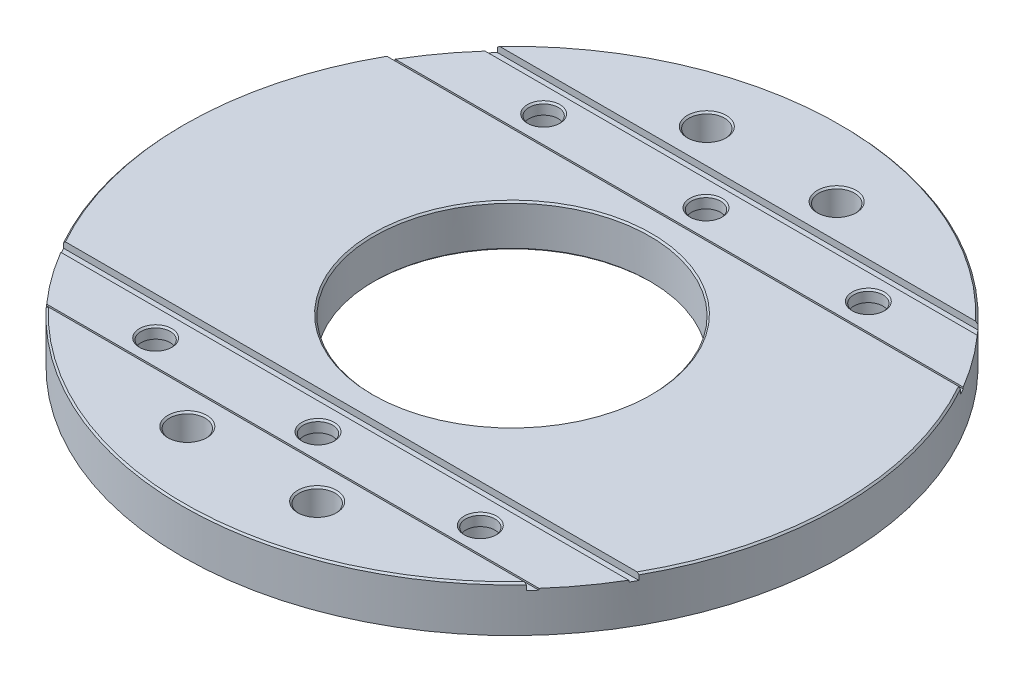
ISO-10303-21;
HEADER;
FILE_DESCRIPTION(('STEP AP214'),'2;1');
FILE_NAME('part.step','',(''),(''),'','','');
FILE_SCHEMA(('AUTOMOTIVE_DESIGN { 1 0 10303 214 1 1 1 1 }'));
ENDSEC;
DATA;
#1=APPLICATION_CONTEXT('core data for automotive mechanical design processes');
#2=APPLICATION_PROTOCOL_DEFINITION('international standard','automotive_design',2000,#1);
#3=PRODUCT_CONTEXT('',#1,'mechanical');
#4=PRODUCT('Part','Part','',(#3));
#5=PRODUCT_RELATED_PRODUCT_CATEGORY('part','',(#4));
#6=PRODUCT_DEFINITION_FORMATION('','',#4);
#7=PRODUCT_DEFINITION_CONTEXT('part definition',#1,'design');
#8=PRODUCT_DEFINITION('design','',#6,#7);
#9=PRODUCT_DEFINITION_SHAPE('','',#8);
#10=(LENGTH_UNIT() NAMED_UNIT(*) SI_UNIT(.MILLI.,.METRE.));
#11=(NAMED_UNIT(*) PLANE_ANGLE_UNIT() SI_UNIT($,.RADIAN.));
#12=(NAMED_UNIT(*) SI_UNIT($,.STERADIAN.) SOLID_ANGLE_UNIT());
#13=UNCERTAINTY_MEASURE_WITH_UNIT(LENGTH_MEASURE(1.E-05),#10,'distance_accuracy_value','');
#14=(GEOMETRIC_REPRESENTATION_CONTEXT(3) GLOBAL_UNCERTAINTY_ASSIGNED_CONTEXT((#13)) GLOBAL_UNIT_ASSIGNED_CONTEXT((#10,
#11,#12)) REPRESENTATION_CONTEXT('',''));
#15=CARTESIAN_POINT('',(0.,0.,0.));
#16=DIRECTION('',(0.,0.,1.));
#17=DIRECTION('',(1.,0.,0.));
#18=AXIS2_PLACEMENT_3D('',#15,#16,#17);
#19=CARTESIAN_POINT('',(0.,44.8465259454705,0.));
#20=DIRECTION('',(0.,1.,0.));
#21=DIRECTION('',(0.,0.,1.));
#22=AXIS2_PLACEMENT_3D('',#19,#20,#21);
#23=CYLINDRICAL_SURFACE('',#22,87.5);
#24=DIRECTION('',(0.,1.,0.));
#25=VECTOR('',#24,1.);
#26=CARTESIAN_POINT('',(-19.0096158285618,-12.,85.4100960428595));
#27=LINE('',#26,#25);
#28=CARTESIAN_POINT('',(-19.0096158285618,-13.,85.4100960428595));
#29=VERTEX_POINT('',#28);
#30=CARTESIAN_POINT('',(-19.0096158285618,-11.,85.4100960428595));
#31=VERTEX_POINT('',#30);
#32=EDGE_CURVE('E546',#29,#31,#27,.T.);
#33=ORIENTED_EDGE('',*,*,#32,.F.);
#34=CARTESIAN_POINT('',(0.,-13.,0.));
#35=DIRECTION('',(0.,1.,0.));
#36=DIRECTION('',(0.,0.,1.));
#37=AXIS2_PLACEMENT_3D('',#34,#35,#36);
#38=CIRCLE('',#37,87.5);
#39=CARTESIAN_POINT('',(19.0096158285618,-13.,85.4100960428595));
#40=VERTEX_POINT('',#39);
#41=EDGE_CURVE('E560',#29,#40,#38,.T.);
#42=ORIENTED_EDGE('',*,*,#41,.T.);
#43=DIRECTION('',(0.,1.,0.));
#44=VECTOR('',#43,1.);
#45=CARTESIAN_POINT('',(19.0096158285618,-12.,85.4100960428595));
#46=LINE('',#45,#44);
#47=CARTESIAN_POINT('',(19.0096158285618,-11.,85.4100960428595));
#48=VERTEX_POINT('',#47);
#49=EDGE_CURVE('E698',#48,#40,#46,.F.);
#50=ORIENTED_EDGE('',*,*,#49,.F.);
#51=CARTESIAN_POINT('',(0.,-11.,0.));
#52=DIRECTION('',(0.,1.,0.));
#53=DIRECTION('',(0.,0.,1.));
#54=AXIS2_PLACEMENT_3D('',#51,#52,#53);
#55=CIRCLE('',#54,87.5);
#56=EDGE_CURVE('E562',#31,#48,#55,.T.);
#57=ORIENTED_EDGE('',*,*,#56,.F.);
#58=EDGE_LOOP('',(#33,#42,#50,#57));
#59=FACE_BOUND('',#58,.T.);
#60=ADVANCED_FACE('F356',(#59),#23,.T.);
#61=DIRECTION('',(0.,1.,0.));
#62=VECTOR('',#61,1.);
#63=CARTESIAN_POINT('',(19.0096158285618,-12.,-85.4100960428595));
#64=LINE('',#63,#62);
#65=CARTESIAN_POINT('',(19.0096158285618,-13.,-85.4100960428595));
#66=VERTEX_POINT('',#65);
#67=CARTESIAN_POINT('',(19.0096158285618,-11.,-85.4100960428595));
#68=VERTEX_POINT('',#67);
#69=EDGE_CURVE('E703',#66,#68,#64,.T.);
#70=ORIENTED_EDGE('',*,*,#69,.F.);
#71=CARTESIAN_POINT('',(-19.0096158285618,-13.,-85.4100960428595));
#72=VERTEX_POINT('',#71);
#73=EDGE_CURVE('E572',#66,#72,#38,.T.);
#74=ORIENTED_EDGE('',*,*,#73,.T.);
#75=DIRECTION('',(0.,1.,0.));
#76=VECTOR('',#75,1.);
#77=CARTESIAN_POINT('',(-19.0096158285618,-12.,-85.4100960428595));
#78=LINE('',#77,#76);
#79=CARTESIAN_POINT('',(-19.0096158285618,-11.,-85.4100960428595));
#80=VERTEX_POINT('',#79);
#81=EDGE_CURVE('E692',#80,#72,#78,.F.);
#82=ORIENTED_EDGE('',*,*,#81,.F.);
#83=EDGE_CURVE('E588',#68,#80,#55,.T.);
#84=ORIENTED_EDGE('',*,*,#83,.F.);
#85=EDGE_LOOP('',(#70,#74,#82,#84));
#86=FACE_BOUND('',#85,.T.);
#87=ADVANCED_FACE('F880',(#86),#23,.T.);
#88=DIRECTION('',(0.,1.,0.));
#89=VECTOR('',#88,1.);
#90=CARTESIAN_POINT('',(23.4197959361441,-12.,-84.307551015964));
#91=LINE('',#90,#89);
#92=CARTESIAN_POINT('',(23.4197959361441,-11.,-84.307551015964));
#93=VERTEX_POINT('',#92);
#94=CARTESIAN_POINT('',(23.4197959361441,-13.,-84.307551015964));
#95=VERTEX_POINT('',#94);
#96=EDGE_CURVE('E705',#93,#95,#91,.F.);
#97=ORIENTED_EDGE('',*,*,#96,.F.);
#98=CARTESIAN_POINT('',(23.4197959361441,-11.,84.307551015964));
#99=VERTEX_POINT('',#98);
#100=EDGE_CURVE('E584',#99,#93,#55,.T.);
#101=ORIENTED_EDGE('',*,*,#100,.F.);
#102=DIRECTION('',(0.,1.,0.));
#103=VECTOR('',#102,1.);
#104=CARTESIAN_POINT('',(23.4197959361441,-12.,84.307551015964));
#105=LINE('',#104,#103);
#106=CARTESIAN_POINT('',(23.4197959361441,-13.,84.307551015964));
#107=VERTEX_POINT('',#106);
#108=EDGE_CURVE('E696',#107,#99,#105,.T.);
#109=ORIENTED_EDGE('',*,*,#108,.F.);
#110=EDGE_CURVE('E570',#107,#95,#38,.T.);
#111=ORIENTED_EDGE('',*,*,#110,.T.);
#112=EDGE_LOOP('',(#97,#101,#109,#111));
#113=FACE_BOUND('',#112,.T.);
#114=ADVANCED_FACE('F885',(#113),#23,.T.);
#115=CARTESIAN_POINT('',(-101.5,0.,0.));
#116=DIRECTION('',(0.,1.,0.));
#117=DIRECTION('',(0.,0.,1.));
#118=AXIS2_PLACEMENT_3D('',#115,#116,#117);
#119=PLANE('',#118);
#120=CARTESIAN_POINT('',(-20.,0.,-80.));
#121=DIRECTION('',(0.,1.,0.));
#122=DIRECTION('',(0.,0.,1.));
#123=AXIS2_PLACEMENT_3D('',#120,#121,#122);
#124=CIRCLE('',#123,6.00000000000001);
#125=CARTESIAN_POINT('',(-20.,0.,-74.));
#126=VERTEX_POINT('',#125);
#127=EDGE_CURVE('E364',#126,#126,#124,.F.);
#128=ORIENTED_EDGE('',*,*,#127,.T.);
#129=EDGE_LOOP('',(#128));
#130=FACE_BOUND('',#129,.T.);
#131=CARTESIAN_POINT('',(20.,0.,-80.));
#132=DIRECTION('',(0.,1.,0.));
#133=DIRECTION('',(0.,0.,1.));
#134=AXIS2_PLACEMENT_3D('',#131,#132,#133);
#135=CIRCLE('',#134,5.99999999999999);
#136=CARTESIAN_POINT('',(20.,0.,-74.));
#137=VERTEX_POINT('',#136);
#138=EDGE_CURVE('E1518',#137,#137,#135,.F.);
#139=ORIENTED_EDGE('',*,*,#138,.T.);
#140=EDGE_LOOP('',(#139));
#141=FACE_BOUND('',#140,.T.);
#142=DIRECTION('',(1.,0.,0.));
#143=VECTOR('',#142,1.);
#144=CARTESIAN_POINT('',(-101.5,0.,-69.5));
#145=LINE('',#144,#143);
#146=CARTESIAN_POINT('',(-73.2854010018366,0.,-69.5));
#147=VERTEX_POINT('',#146);
#148=CARTESIAN_POINT('',(73.2854010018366,0.,-69.5));
#149=VERTEX_POINT('',#148);
#150=EDGE_CURVE('E631',#147,#149,#145,.T.);
#151=ORIENTED_EDGE('',*,*,#150,.T.);
#152=CARTESIAN_POINT('',(0.,0.,0.));
#153=DIRECTION('',(0.,1.,0.));
#154=DIRECTION('',(0.,0.,1.));
#155=AXIS2_PLACEMENT_3D('',#152,#153,#154);
#156=CIRCLE('',#155,101.);
#157=EDGE_CURVE('E1444',#149,#147,#156,.T.);
#158=ORIENTED_EDGE('',*,*,#157,.T.);
#159=EDGE_LOOP('',(#151,#158));
#160=FACE_BOUND('',#159,.T.);
#161=ADVANCED_FACE('F898',(#130,#141,#160),#119,.T.);
#162=CARTESIAN_POINT('',(0.,0.,0.));
#163=DIRECTION('',(0.,1.,0.));
#164=DIRECTION('',(0.,0.,1.));
#165=AXIS2_PLACEMENT_3D('',#162,#163,#164);
#166=CIRCLE('',#165,43.);
#167=CARTESIAN_POINT('',(0.,0.,43.));
#168=VERTEX_POINT('',#167);
#169=EDGE_CURVE('E1589',#168,#168,#166,.F.);
#170=ORIENTED_EDGE('',*,*,#169,.T.);
#171=EDGE_LOOP('',(#170));
#172=FACE_BOUND('',#171,.T.);
#173=DIRECTION('',(-1.,0.,0.));
#174=VECTOR('',#173,1.);
#175=CARTESIAN_POINT('',(-101.5,0.,-49.5));
#176=LINE('',#175,#174);
#177=CARTESIAN_POINT('',(88.0383439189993,0.,-49.5));
#178=VERTEX_POINT('',#177);
#179=CARTESIAN_POINT('',(-88.0383439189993,0.,-49.5));
#180=VERTEX_POINT('',#179);
#181=EDGE_CURVE('E633',#178,#180,#176,.T.);
#182=ORIENTED_EDGE('',*,*,#181,.T.);
#183=CARTESIAN_POINT('',(0.,0.,0.));
#184=DIRECTION('',(0.,1.,0.));
#185=DIRECTION('',(0.,0.,1.));
#186=AXIS2_PLACEMENT_3D('',#183,#184,#185);
#187=CIRCLE('',#186,101.);
#188=CARTESIAN_POINT('',(-88.0383439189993,0.,49.5));
#189=VERTEX_POINT('',#188);
#190=EDGE_CURVE('E728',#180,#189,#187,.T.);
#191=ORIENTED_EDGE('',*,*,#190,.T.);
#192=DIRECTION('',(1.,0.,0.));
#193=VECTOR('',#192,1.);
#194=CARTESIAN_POINT('',(-101.5,0.,49.5));
#195=LINE('',#194,#193);
#196=CARTESIAN_POINT('',(88.0383439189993,0.,49.5));
#197=VERTEX_POINT('',#196);
#198=EDGE_CURVE('E610',#189,#197,#195,.T.);
#199=ORIENTED_EDGE('',*,*,#198,.T.);
#200=CARTESIAN_POINT('',(0.,0.,0.));
#201=DIRECTION('',(0.,1.,0.));
#202=DIRECTION('',(0.,0.,1.));
#203=AXIS2_PLACEMENT_3D('',#200,#201,#202);
#204=CIRCLE('',#203,101.);
#205=EDGE_CURVE('E554',#197,#178,#204,.T.);
#206=ORIENTED_EDGE('',*,*,#205,.T.);
#207=EDGE_LOOP('',(#182,#191,#199,#206));
#208=FACE_BOUND('',#207,.T.);
#209=ADVANCED_FACE('F903',(#172,#208),#119,.T.);
#210=CARTESIAN_POINT('',(0.,44.8465259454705,0.));
#211=DIRECTION('',(0.,1.,0.));
#212=DIRECTION('',(0.,0.,1.));
#213=AXIS2_PLACEMENT_3D('',#210,#211,#212);
#214=CYLINDRICAL_SURFACE('',#213,101.5);
#215=CARTESIAN_POINT('',(0.,-14.,0.));
#216=DIRECTION('',(0.,1.,0.));
#217=DIRECTION('',(0.,0.,1.));
#218=AXIS2_PLACEMENT_3D('',#215,#216,#217);
#219=CIRCLE('',#218,101.5);
#220=CARTESIAN_POINT('',(0.,-14.,101.5));
#221=VERTEX_POINT('',#220);
#222=EDGE_CURVE('E602',#221,#221,#219,.T.);
#223=ORIENTED_EDGE('',*,*,#222,.T.);
#224=EDGE_LOOP('',(#223));
#225=FACE_BOUND('',#224,.T.);
#226=DIRECTION('',(0.,1.,0.));
#227=VECTOR('',#226,1.);
#228=CARTESIAN_POINT('',(-88.6115116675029,44.8465259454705,49.5));
#229=LINE('',#228,#227);
#230=CARTESIAN_POINT('',(-88.6115116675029,-2.,49.5));
#231=VERTEX_POINT('',#230);
#232=CARTESIAN_POINT('',(-88.6115116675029,-0.5,49.5));
#233=VERTEX_POINT('',#232);
#234=EDGE_CURVE('E573',#231,#233,#229,.T.);
#235=ORIENTED_EDGE('',*,*,#234,.T.);
#236=CARTESIAN_POINT('',(0.,-0.5,0.));
#237=DIRECTION('',(0.,1.,0.));
#238=DIRECTION('',(0.,0.,1.));
#239=AXIS2_PLACEMENT_3D('',#236,#237,#238);
#240=CIRCLE('',#239,101.5);
#241=CARTESIAN_POINT('',(-88.6115116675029,-0.499999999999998,-49.5));
#242=VERTEX_POINT('',#241);
#243=EDGE_CURVE('E769',#233,#242,#240,.F.);
#244=ORIENTED_EDGE('',*,*,#243,.T.);
#245=DIRECTION('',(0.,1.,0.));
#246=VECTOR('',#245,1.);
#247=CARTESIAN_POINT('',(-88.6115116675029,44.8465259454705,-49.5));
#248=LINE('',#247,#246);
#249=CARTESIAN_POINT('',(-88.6115116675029,-1.99999999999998,-49.5));
#250=VERTEX_POINT('',#249);
#251=EDGE_CURVE('E721',#242,#250,#248,.F.);
#252=ORIENTED_EDGE('',*,*,#251,.T.);
#253=CARTESIAN_POINT('',(0.,-1.99999999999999,0.));
#254=DIRECTION('',(0.,1.,0.));
#255=DIRECTION('',(0.,0.,1.));
#256=AXIS2_PLACEMENT_3D('',#253,#254,#255);
#257=CIRCLE('',#256,101.5);
#258=CARTESIAN_POINT('',(-87.4642784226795,-1.99999999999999,-51.5));
#259=VERTEX_POINT('',#258);
#260=EDGE_CURVE('E1029',#250,#259,#257,.F.);
#261=ORIENTED_EDGE('',*,*,#260,.T.);
#262=DIRECTION('',(0.,1.,0.));
#263=VECTOR('',#262,1.);
#264=CARTESIAN_POINT('',(-87.4642784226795,44.8465259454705,-51.5));
#265=LINE('',#264,#263);
#266=CARTESIAN_POINT('',(-87.4642784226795,-1.49999999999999,-51.5));
#267=VERTEX_POINT('',#266);
#268=EDGE_CURVE('E1016',#259,#267,#265,.T.);
#269=ORIENTED_EDGE('',*,*,#268,.T.);
#270=CARTESIAN_POINT('',(0.,-1.5,0.));
#271=DIRECTION('',(0.,1.,0.));
#272=DIRECTION('',(0.,0.,1.));
#273=AXIS2_PLACEMENT_3D('',#270,#271,#272);
#274=CIRCLE('',#273,101.5);
#275=CARTESIAN_POINT('',(-75.8023746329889,-1.49999999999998,-67.5));
#276=VERTEX_POINT('',#275);
#277=EDGE_CURVE('E1027',#267,#276,#274,.F.);
#278=ORIENTED_EDGE('',*,*,#277,.T.);
#279=DIRECTION('',(0.,1.,0.));
#280=VECTOR('',#279,1.);
#281=CARTESIAN_POINT('',(-75.8023746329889,44.8465259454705,-67.5));
#282=LINE('',#281,#280);
#283=CARTESIAN_POINT('',(-75.8023746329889,-1.99999999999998,-67.5));
#284=VERTEX_POINT('',#283);
#285=EDGE_CURVE('E1033',#276,#284,#282,.F.);
#286=ORIENTED_EDGE('',*,*,#285,.T.);
#287=CARTESIAN_POINT('',(0.,-1.99999999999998,0.));
#288=DIRECTION('',(0.,1.,0.));
#289=DIRECTION('',(0.,0.,1.));
#290=AXIS2_PLACEMENT_3D('',#287,#288,#289);
#291=CIRCLE('',#290,101.5);
#292=CARTESIAN_POINT('',(-73.9729680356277,-1.99999999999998,-69.5));
#293=VERTEX_POINT('',#292);
#294=EDGE_CURVE('E1049',#284,#293,#291,.F.);
#295=ORIENTED_EDGE('',*,*,#294,.T.);
#296=DIRECTION('',(0.,1.,0.));
#297=VECTOR('',#296,1.);
#298=CARTESIAN_POINT('',(-73.9729680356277,44.8465259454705,-69.5));
#299=LINE('',#298,#297);
#300=CARTESIAN_POINT('',(-73.9729680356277,-0.5,-69.5));
#301=VERTEX_POINT('',#300);
#302=EDGE_CURVE('E717',#293,#301,#299,.T.);
#303=ORIENTED_EDGE('',*,*,#302,.T.);
#304=CARTESIAN_POINT('',(0.,-0.5,0.));
#305=DIRECTION('',(0.,1.,0.));
#306=DIRECTION('',(0.,0.,1.));
#307=AXIS2_PLACEMENT_3D('',#304,#305,#306);
#308=CIRCLE('',#307,101.5);
#309=CARTESIAN_POINT('',(73.9729680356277,-0.500000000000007,-69.5));
#310=VERTEX_POINT('',#309);
#311=EDGE_CURVE('E1095',#301,#310,#308,.F.);
#312=ORIENTED_EDGE('',*,*,#311,.T.);
#313=DIRECTION('',(0.,1.,0.));
#314=VECTOR('',#313,1.);
#315=CARTESIAN_POINT('',(73.9729680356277,44.8465259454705,-69.5));
#316=LINE('',#315,#314);
#317=CARTESIAN_POINT('',(73.9729680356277,-1.99999999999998,-69.5));
#318=VERTEX_POINT('',#317);
#319=EDGE_CURVE('E1047',#310,#318,#316,.F.);
#320=ORIENTED_EDGE('',*,*,#319,.T.);
#321=CARTESIAN_POINT('',(75.8023746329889,-1.99999999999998,-67.5));
#322=VERTEX_POINT('',#321);
#323=EDGE_CURVE('E1055',#318,#322,#291,.F.);
#324=ORIENTED_EDGE('',*,*,#323,.T.);
#325=DIRECTION('',(0.,1.,0.));
#326=VECTOR('',#325,1.);
#327=CARTESIAN_POINT('',(75.8023746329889,44.8465259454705,-67.5));
#328=LINE('',#327,#326);
#329=CARTESIAN_POINT('',(75.8023746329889,-1.49999999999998,-67.5));
#330=VERTEX_POINT('',#329);
#331=EDGE_CURVE('E1052',#322,#330,#328,.T.);
#332=ORIENTED_EDGE('',*,*,#331,.T.);
#333=CARTESIAN_POINT('',(87.4642784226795,-1.49999999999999,-51.5));
#334=VERTEX_POINT('',#333);
#335=EDGE_CURVE('E1035',#330,#334,#274,.F.);
#336=ORIENTED_EDGE('',*,*,#335,.T.);
#337=DIRECTION('',(0.,1.,0.));
#338=VECTOR('',#337,1.);
#339=CARTESIAN_POINT('',(87.4642784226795,44.8465259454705,-51.5));
#340=LINE('',#339,#338);
#341=CARTESIAN_POINT('',(87.4642784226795,-1.99999999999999,-51.5));
#342=VERTEX_POINT('',#341);
#343=EDGE_CURVE('E1018',#334,#342,#340,.F.);
#344=ORIENTED_EDGE('',*,*,#343,.T.);
#345=CARTESIAN_POINT('',(88.6115116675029,-1.99999999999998,-49.5));
#346=VERTEX_POINT('',#345);
#347=EDGE_CURVE('E1032',#342,#346,#257,.F.);
#348=ORIENTED_EDGE('',*,*,#347,.T.);
#349=DIRECTION('',(0.,1.,0.));
#350=VECTOR('',#349,1.);
#351=CARTESIAN_POINT('',(88.6115116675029,44.8465259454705,-49.5));
#352=LINE('',#351,#350);
#353=CARTESIAN_POINT('',(88.6115116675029,-0.5,-49.5));
#354=VERTEX_POINT('',#353);
#355=EDGE_CURVE('E1044',#346,#354,#352,.T.);
#356=ORIENTED_EDGE('',*,*,#355,.T.);
#357=CARTESIAN_POINT('',(0.,-0.5,0.));
#358=DIRECTION('',(0.,1.,0.));
#359=DIRECTION('',(0.,0.,1.));
#360=AXIS2_PLACEMENT_3D('',#357,#358,#359);
#361=CIRCLE('',#360,101.5);
#362=CARTESIAN_POINT('',(88.6115116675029,-0.499999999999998,49.5));
#363=VERTEX_POINT('',#362);
#364=EDGE_CURVE('E1092',#354,#363,#361,.F.);
#365=ORIENTED_EDGE('',*,*,#364,.T.);
#366=DIRECTION('',(0.,1.,0.));
#367=VECTOR('',#366,1.);
#368=CARTESIAN_POINT('',(88.6115116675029,44.8465259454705,49.5));
#369=LINE('',#368,#367);
#370=CARTESIAN_POINT('',(88.6115116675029,-2.,49.5));
#371=VERTEX_POINT('',#370);
#372=EDGE_CURVE('E1070',#363,#371,#369,.F.);
#373=ORIENTED_EDGE('',*,*,#372,.T.);
#374=CARTESIAN_POINT('',(0.,-2.,0.));
#375=DIRECTION('',(0.,1.,0.));
#376=DIRECTION('',(0.,0.,1.));
#377=AXIS2_PLACEMENT_3D('',#374,#375,#376);
#378=CIRCLE('',#377,101.5);
#379=CARTESIAN_POINT('',(87.4642784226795,-2.,51.5));
#380=VERTEX_POINT('',#379);
#381=EDGE_CURVE('E1069',#371,#380,#378,.F.);
#382=ORIENTED_EDGE('',*,*,#381,.T.);
#383=DIRECTION('',(0.,1.,0.));
#384=VECTOR('',#383,1.);
#385=CARTESIAN_POINT('',(87.4642784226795,44.8465259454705,51.5));
#386=LINE('',#385,#384);
#387=CARTESIAN_POINT('',(87.4642784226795,-1.5,51.5));
#388=VERTEX_POINT('',#387);
#389=EDGE_CURVE('E1066',#380,#388,#386,.T.);
#390=ORIENTED_EDGE('',*,*,#389,.T.);
#391=CARTESIAN_POINT('',(0.,-1.5,0.));
#392=DIRECTION('',(0.,1.,0.));
#393=DIRECTION('',(0.,0.,1.));
#394=AXIS2_PLACEMENT_3D('',#391,#392,#393);
#395=CIRCLE('',#394,101.5);
#396=CARTESIAN_POINT('',(75.8023746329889,-1.5,67.5));
#397=VERTEX_POINT('',#396);
#398=EDGE_CURVE('E1065',#388,#397,#395,.F.);
#399=ORIENTED_EDGE('',*,*,#398,.T.);
#400=DIRECTION('',(0.,1.,0.));
#401=VECTOR('',#400,1.);
#402=CARTESIAN_POINT('',(75.8023746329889,44.8465259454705,67.5));
#403=LINE('',#402,#401);
#404=CARTESIAN_POINT('',(75.8023746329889,-2.,67.5));
#405=VERTEX_POINT('',#404);
#406=EDGE_CURVE('E1062',#397,#405,#403,.F.);
#407=ORIENTED_EDGE('',*,*,#406,.T.);
#408=CARTESIAN_POINT('',(0.,-1.99999999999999,0.));
#409=DIRECTION('',(0.,1.,0.));
#410=DIRECTION('',(0.,0.,1.));
#411=AXIS2_PLACEMENT_3D('',#408,#409,#410);
#412=CIRCLE('',#411,101.5);
#413=CARTESIAN_POINT('',(73.9729680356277,-2.,69.5));
#414=VERTEX_POINT('',#413);
#415=EDGE_CURVE('E1061',#405,#414,#412,.F.);
#416=ORIENTED_EDGE('',*,*,#415,.T.);
#417=DIRECTION('',(0.,1.,0.));
#418=VECTOR('',#417,1.);
#419=CARTESIAN_POINT('',(73.9729680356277,44.8465259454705,69.5));
#420=LINE('',#419,#418);
#421=CARTESIAN_POINT('',(73.9729680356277,-0.5,69.5));
#422=VERTEX_POINT('',#421);
#423=EDGE_CURVE('E1058',#414,#422,#420,.T.);
#424=ORIENTED_EDGE('',*,*,#423,.T.);
#425=CARTESIAN_POINT('',(0.,-0.5,0.));
#426=DIRECTION('',(0.,1.,0.));
#427=DIRECTION('',(0.,0.,1.));
#428=AXIS2_PLACEMENT_3D('',#425,#426,#427);
#429=CIRCLE('',#428,101.5);
#430=CARTESIAN_POINT('',(-73.9729680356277,-0.500000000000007,69.5));
#431=VERTEX_POINT('',#430);
#432=EDGE_CURVE('E1093',#422,#431,#429,.F.);
#433=ORIENTED_EDGE('',*,*,#432,.T.);
#434=DIRECTION('',(0.,1.,0.));
#435=VECTOR('',#434,1.);
#436=CARTESIAN_POINT('',(-73.9729680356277,44.8465259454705,69.5));
#437=LINE('',#436,#435);
#438=CARTESIAN_POINT('',(-73.9729680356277,-2.,69.5));
#439=VERTEX_POINT('',#438);
#440=EDGE_CURVE('E1072',#431,#439,#437,.F.);
#441=ORIENTED_EDGE('',*,*,#440,.T.);
#442=CARTESIAN_POINT('',(-75.8023746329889,-2.,67.5));
#443=VERTEX_POINT('',#442);
#444=EDGE_CURVE('E1074',#439,#443,#412,.F.);
#445=ORIENTED_EDGE('',*,*,#444,.T.);
#446=DIRECTION('',(0.,1.,0.));
#447=VECTOR('',#446,1.);
#448=CARTESIAN_POINT('',(-75.8023746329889,44.8465259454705,67.5));
#449=LINE('',#448,#447);
#450=CARTESIAN_POINT('',(-75.8023746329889,-1.5,67.5));
#451=VERTEX_POINT('',#450);
#452=EDGE_CURVE('E1077',#443,#451,#449,.T.);
#453=ORIENTED_EDGE('',*,*,#452,.T.);
#454=CARTESIAN_POINT('',(-87.4642784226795,-1.5,51.5));
#455=VERTEX_POINT('',#454);
#456=EDGE_CURVE('E1080',#451,#455,#395,.F.);
#457=ORIENTED_EDGE('',*,*,#456,.T.);
#458=DIRECTION('',(0.,1.,0.));
#459=VECTOR('',#458,1.);
#460=CARTESIAN_POINT('',(-87.4642784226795,44.8465259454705,51.5));
#461=LINE('',#460,#459);
#462=CARTESIAN_POINT('',(-87.4642784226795,-2.,51.5));
#463=VERTEX_POINT('',#462);
#464=EDGE_CURVE('E1083',#455,#463,#461,.F.);
#465=ORIENTED_EDGE('',*,*,#464,.T.);
#466=EDGE_CURVE('E1086',#463,#231,#378,.F.);
#467=ORIENTED_EDGE('',*,*,#466,.T.);
#468=EDGE_LOOP('',(#235,#244,#252,#261,#269,#278,#286,#295,#303,#312,#320,#324,#332,#336,#344,
#348,#356,#365,#373,#382,#390,#399,#407,#416,#424,#433,#441,#445,#453,#457,#465,#467));
#469=FACE_BOUND('',#468,.T.);
#470=ADVANCED_FACE('F1025',(#225,#469),#214,.T.);
#471=CARTESIAN_POINT('',(20.,0.,80.));
#472=DIRECTION('',(0.,1.,0.));
#473=DIRECTION('',(0.,0.,1.));
#474=AXIS2_PLACEMENT_3D('',#471,#472,#473);
#475=CIRCLE('',#474,5.99999999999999);
#476=CARTESIAN_POINT('',(20.,0.,86.));
#477=VERTEX_POINT('',#476);
#478=EDGE_CURVE('E1456',#477,#477,#475,.F.);
#479=ORIENTED_EDGE('',*,*,#478,.T.);
#480=EDGE_LOOP('',(#479));
#481=FACE_BOUND('',#480,.T.);
#482=CARTESIAN_POINT('',(-20.,0.,80.));
#483=DIRECTION('',(0.,1.,0.));
#484=DIRECTION('',(0.,0.,1.));
#485=AXIS2_PLACEMENT_3D('',#482,#483,#484);
#486=CIRCLE('',#485,5.99999999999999);
#487=CARTESIAN_POINT('',(-20.,0.,86.));
#488=VERTEX_POINT('',#487);
#489=EDGE_CURVE('E1462',#488,#488,#486,.F.);
#490=ORIENTED_EDGE('',*,*,#489,.T.);
#491=EDGE_LOOP('',(#490));
#492=FACE_BOUND('',#491,.T.);
#493=DIRECTION('',(-1.,0.,0.));
#494=VECTOR('',#493,1.);
#495=CARTESIAN_POINT('',(-101.5,0.,69.5));
#496=LINE('',#495,#494);
#497=CARTESIAN_POINT('',(73.2854010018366,0.,69.5));
#498=VERTEX_POINT('',#497);
#499=CARTESIAN_POINT('',(-73.2854010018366,0.,69.5));
#500=VERTEX_POINT('',#499);
#501=EDGE_CURVE('E607',#498,#500,#496,.T.);
#502=ORIENTED_EDGE('',*,*,#501,.T.);
#503=CARTESIAN_POINT('',(0.,0.,0.));
#504=DIRECTION('',(0.,1.,0.));
#505=DIRECTION('',(0.,0.,1.));
#506=AXIS2_PLACEMENT_3D('',#503,#504,#505);
#507=CIRCLE('',#506,101.);
#508=EDGE_CURVE('E1101',#500,#498,#507,.T.);
#509=ORIENTED_EDGE('',*,*,#508,.T.);
#510=EDGE_LOOP('',(#502,#509));
#511=FACE_BOUND('',#510,.T.);
#512=ADVANCED_FACE('F358',(#481,#492,#511),#119,.T.);
#513=CARTESIAN_POINT('',(0.,44.8465259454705,0.));
#514=DIRECTION('',(0.,1.,0.));
#515=DIRECTION('',(0.,0.,1.));
#516=AXIS2_PLACEMENT_3D('',#513,#514,#515);
#517=CYLINDRICAL_SURFACE('',#516,42.5);
#518=CARTESIAN_POINT('',(0.,-0.5,0.));
#519=DIRECTION('',(0.,1.,0.));
#520=DIRECTION('',(0.,0.,1.));
#521=AXIS2_PLACEMENT_3D('',#518,#519,#520);
#522=CIRCLE('',#521,42.5);
#523=CARTESIAN_POINT('',(0.,-0.5,42.5));
#524=VERTEX_POINT('',#523);
#525=EDGE_CURVE('E1595',#524,#524,#522,.T.);
#526=ORIENTED_EDGE('',*,*,#525,.T.);
#527=EDGE_LOOP('',(#526));
#528=FACE_BOUND('',#527,.T.);
#529=CARTESIAN_POINT('',(0.,-12.5,0.));
#530=DIRECTION('',(0.,-1.,0.));
#531=DIRECTION('',(0.,0.,-1.));
#532=AXIS2_PLACEMENT_3D('',#529,#530,#531);
#533=CIRCLE('',#532,42.5);
#534=CARTESIAN_POINT('',(0.,-12.5,-42.5));
#535=VERTEX_POINT('',#534);
#536=EDGE_CURVE('E797',#535,#535,#533,.T.);
#537=ORIENTED_EDGE('',*,*,#536,.T.);
#538=EDGE_LOOP('',(#537));
#539=FACE_BOUND('',#538,.T.);
#540=ADVANCED_FACE('F895',(#528,#539),#517,.F.);
#541=CARTESIAN_POINT('',(-42.5,-13.,0.));
#542=DIRECTION('',(0.,-1.,0.));
#543=DIRECTION('',(0.,0.,-1.));
#544=AXIS2_PLACEMENT_3D('',#541,#542,#543);
#545=PLANE('',#544);
#546=CARTESIAN_POINT('',(-50.,-13.,59.75));
#547=DIRECTION('',(0.,-1.,0.));
#548=DIRECTION('',(0.,0.,-1.));
#549=AXIS2_PLACEMENT_3D('',#546,#547,#548);
#550=CIRCLE('',#549,7.64999999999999);
#551=CARTESIAN_POINT('',(-50.,-13.,52.1));
#552=VERTEX_POINT('',#551);
#553=EDGE_CURVE('E1480',#552,#552,#550,.F.);
#554=ORIENTED_EDGE('',*,*,#553,.T.);
#555=EDGE_LOOP('',(#554));
#556=FACE_BOUND('',#555,.T.);
#557=CARTESIAN_POINT('',(0.,-13.,59.75));
#558=DIRECTION('',(0.,-1.,0.));
#559=DIRECTION('',(0.,0.,-1.));
#560=AXIS2_PLACEMENT_3D('',#557,#558,#559);
#561=CIRCLE('',#560,7.65);
#562=CARTESIAN_POINT('',(0.,-13.,52.1));
#563=VERTEX_POINT('',#562);
#564=EDGE_CURVE('E1477',#563,#563,#561,.F.);
#565=ORIENTED_EDGE('',*,*,#564,.T.);
#566=EDGE_LOOP('',(#565));
#567=FACE_BOUND('',#566,.T.);
#568=CARTESIAN_POINT('',(50.,-13.,59.75));
#569=DIRECTION('',(0.,-1.,0.));
#570=DIRECTION('',(0.,0.,-1.));
#571=AXIS2_PLACEMENT_3D('',#568,#569,#570);
#572=CIRCLE('',#571,7.64999999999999);
#573=CARTESIAN_POINT('',(50.,-13.,52.1));
#574=VERTEX_POINT('',#573);
#575=EDGE_CURVE('E1474',#574,#574,#572,.F.);
#576=ORIENTED_EDGE('',*,*,#575,.T.);
#577=EDGE_LOOP('',(#576));
#578=FACE_BOUND('',#577,.T.);
#579=CARTESIAN_POINT('',(0.,-13.,-59.75));
#580=DIRECTION('',(0.,-1.,0.));
#581=DIRECTION('',(0.,0.,-1.));
#582=AXIS2_PLACEMENT_3D('',#579,#580,#581);
#583=CIRCLE('',#582,7.64999999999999);
#584=CARTESIAN_POINT('',(0.,-13.,-67.4));
#585=VERTEX_POINT('',#584);
#586=EDGE_CURVE('E1471',#585,#585,#583,.F.);
#587=ORIENTED_EDGE('',*,*,#586,.T.);
#588=EDGE_LOOP('',(#587));
#589=FACE_BOUND('',#588,.T.);
#590=CARTESIAN_POINT('',(50.,-13.,-59.75));
#591=DIRECTION('',(0.,-1.,0.));
#592=DIRECTION('',(0.,0.,-1.));
#593=AXIS2_PLACEMENT_3D('',#590,#591,#592);
#594=CIRCLE('',#593,7.64999999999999);
#595=CARTESIAN_POINT('',(50.,-13.,-67.4));
#596=VERTEX_POINT('',#595);
#597=EDGE_CURVE('E1468',#596,#596,#594,.F.);
#598=ORIENTED_EDGE('',*,*,#597,.T.);
#599=EDGE_LOOP('',(#598));
#600=FACE_BOUND('',#599,.T.);
#601=CARTESIAN_POINT('',(-50.,-13.,-59.75));
#602=DIRECTION('',(0.,-1.,0.));
#603=DIRECTION('',(0.,0.,-1.));
#604=AXIS2_PLACEMENT_3D('',#601,#602,#603);
#605=CIRCLE('',#604,7.64999999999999);
#606=CARTESIAN_POINT('',(-50.,-13.,-67.4));
#607=VERTEX_POINT('',#606);
#608=EDGE_CURVE('E1459',#607,#607,#605,.F.);
#609=ORIENTED_EDGE('',*,*,#608,.T.);
#610=EDGE_LOOP('',(#609));
#611=FACE_BOUND('',#610,.T.);
#612=CARTESIAN_POINT('',(0.,-13.,0.));
#613=DIRECTION('',(0.,-1.,0.));
#614=DIRECTION('',(0.,0.,-1.));
#615=AXIS2_PLACEMENT_3D('',#612,#613,#614);
#616=CIRCLE('',#615,43.);
#617=CARTESIAN_POINT('',(0.,-13.,-43.));
#618=VERTEX_POINT('',#617);
#619=EDGE_CURVE('E1586',#618,#618,#616,.F.);
#620=ORIENTED_EDGE('',*,*,#619,.T.);
#621=EDGE_LOOP('',(#620));
#622=FACE_BOUND('',#621,.T.);
#623=CARTESIAN_POINT('',(-20.,-13.,80.));
#624=DIRECTION('',(0.,-1.,0.));
#625=DIRECTION('',(0.,0.,-1.));
#626=AXIS2_PLACEMENT_3D('',#623,#624,#625);
#627=CIRCLE('',#626,5.49999999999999);
#628=CARTESIAN_POINT('',(-23.4197959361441,-13.,84.307551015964));
#629=VERTEX_POINT('',#628);
#630=EDGE_CURVE('E543',#629,#29,#627,.T.);
#631=ORIENTED_EDGE('',*,*,#630,.F.);
#632=CARTESIAN_POINT('',(-23.4197959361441,-13.,-84.307551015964));
#633=VERTEX_POINT('',#632);
#634=EDGE_CURVE('E569',#633,#629,#38,.T.);
#635=ORIENTED_EDGE('',*,*,#634,.F.);
#636=CARTESIAN_POINT('',(-20.,-13.,-80.));
#637=DIRECTION('',(0.,-1.,0.));
#638=DIRECTION('',(0.,0.,-1.));
#639=AXIS2_PLACEMENT_3D('',#636,#637,#638);
#640=CIRCLE('',#639,5.5);
#641=EDGE_CURVE('E714',#72,#633,#640,.T.);
#642=ORIENTED_EDGE('',*,*,#641,.F.);
#643=ORIENTED_EDGE('',*,*,#73,.F.);
#644=CARTESIAN_POINT('',(20.,-13.,-80.));
#645=DIRECTION('',(0.,-1.,0.));
#646=DIRECTION('',(0.,0.,-1.));
#647=AXIS2_PLACEMENT_3D('',#644,#645,#646);
#648=CIRCLE('',#647,5.49999999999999);
#649=EDGE_CURVE('E555',#95,#66,#648,.T.);
#650=ORIENTED_EDGE('',*,*,#649,.F.);
#651=ORIENTED_EDGE('',*,*,#110,.F.);
#652=CARTESIAN_POINT('',(20.,-13.,80.));
#653=DIRECTION('',(0.,-1.,0.));
#654=DIRECTION('',(0.,0.,-1.));
#655=AXIS2_PLACEMENT_3D('',#652,#653,#654);
#656=CIRCLE('',#655,5.49999999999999);
#657=EDGE_CURVE('E568',#40,#107,#656,.T.);
#658=ORIENTED_EDGE('',*,*,#657,.F.);
#659=ORIENTED_EDGE('',*,*,#41,.F.);
#660=EDGE_LOOP('',(#631,#635,#642,#643,#650,#651,#658,#659));
#661=FACE_BOUND('',#660,.T.);
#662=ADVANCED_FACE('F566',(#556,#567,#578,#589,#600,#611,#622,#661),#545,.T.);
#663=DIRECTION('',(0.,1.,0.));
#664=VECTOR('',#663,1.);
#665=CARTESIAN_POINT('',(-23.4197959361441,-12.,84.307551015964));
#666=LINE('',#665,#664);
#667=CARTESIAN_POINT('',(-23.4197959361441,-11.,84.307551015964));
#668=VERTEX_POINT('',#667);
#669=EDGE_CURVE('E549',#668,#629,#666,.F.);
#670=ORIENTED_EDGE('',*,*,#669,.F.);
#671=CARTESIAN_POINT('',(-23.4197959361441,-11.,-84.307551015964));
#672=VERTEX_POINT('',#671);
#673=EDGE_CURVE('E577',#672,#668,#55,.T.);
#674=ORIENTED_EDGE('',*,*,#673,.F.);
#675=DIRECTION('',(0.,1.,0.));
#676=VECTOR('',#675,1.);
#677=CARTESIAN_POINT('',(-23.4197959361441,-12.,-84.307551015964));
#678=LINE('',#677,#676);
#679=EDGE_CURVE('E690',#633,#672,#678,.T.);
#680=ORIENTED_EDGE('',*,*,#679,.F.);
#681=ORIENTED_EDGE('',*,*,#634,.T.);
#682=EDGE_LOOP('',(#670,#674,#680,#681));
#683=FACE_BOUND('',#682,.T.);
#684=ADVANCED_FACE('F711',(#683),#23,.T.);
#685=CARTESIAN_POINT('',(-87.5,-11.,0.));
#686=DIRECTION('',(0.,-1.,0.));
#687=DIRECTION('',(0.,0.,-1.));
#688=AXIS2_PLACEMENT_3D('',#685,#686,#687);
#689=PLANE('',#688);
#690=CARTESIAN_POINT('',(-20.,-11.,80.));
#691=DIRECTION('',(0.,-1.,0.));
#692=DIRECTION('',(0.,0.,-1.));
#693=AXIS2_PLACEMENT_3D('',#690,#691,#692);
#694=CIRCLE('',#693,5.49999999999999);
#695=EDGE_CURVE('E709',#31,#668,#694,.T.);
#696=ORIENTED_EDGE('',*,*,#695,.F.);
#697=ORIENTED_EDGE('',*,*,#56,.T.);
#698=CARTESIAN_POINT('',(20.,-11.,80.));
#699=DIRECTION('',(0.,-1.,0.));
#700=DIRECTION('',(0.,0.,-1.));
#701=AXIS2_PLACEMENT_3D('',#698,#699,#700);
#702=CIRCLE('',#701,5.49999999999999);
#703=EDGE_CURVE('E700',#99,#48,#702,.T.);
#704=ORIENTED_EDGE('',*,*,#703,.F.);
#705=ORIENTED_EDGE('',*,*,#100,.T.);
#706=CARTESIAN_POINT('',(20.,-11.,-80.));
#707=DIRECTION('',(0.,-1.,0.));
#708=DIRECTION('',(0.,0.,-1.));
#709=AXIS2_PLACEMENT_3D('',#706,#707,#708);
#710=CIRCLE('',#709,5.49999999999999);
#711=EDGE_CURVE('E563',#68,#93,#710,.T.);
#712=ORIENTED_EDGE('',*,*,#711,.F.);
#713=ORIENTED_EDGE('',*,*,#83,.T.);
#714=CARTESIAN_POINT('',(-20.,-11.,-80.));
#715=DIRECTION('',(0.,-1.,0.));
#716=DIRECTION('',(0.,0.,-1.));
#717=AXIS2_PLACEMENT_3D('',#714,#715,#716);
#718=CIRCLE('',#717,5.5);
#719=EDGE_CURVE('E694',#672,#80,#718,.T.);
#720=ORIENTED_EDGE('',*,*,#719,.F.);
#721=ORIENTED_EDGE('',*,*,#673,.T.);
#722=EDGE_LOOP('',(#696,#697,#704,#705,#712,#713,#720,#721));
#723=FACE_BOUND('',#722,.T.);
#724=CARTESIAN_POINT('',(0.,-11.,0.));
#725=DIRECTION('',(0.,1.,0.));
#726=DIRECTION('',(0.,0.,1.));
#727=AXIS2_PLACEMENT_3D('',#724,#725,#726);
#728=CIRCLE('',#727,93.5);
#729=CARTESIAN_POINT('',(0.,-11.,93.5));
#730=VERTEX_POINT('',#729);
#731=EDGE_CURVE('E594',#730,#730,#728,.T.);
#732=ORIENTED_EDGE('',*,*,#731,.F.);
#733=EDGE_LOOP('',(#732));
#734=FACE_BOUND('',#733,.T.);
#735=ADVANCED_FACE('F889',(#723,#734),#689,.T.);
#736=CARTESIAN_POINT('',(0.,44.8465259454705,0.));
#737=DIRECTION('',(0.,1.,0.));
#738=DIRECTION('',(0.,0.,1.));
#739=AXIS2_PLACEMENT_3D('',#736,#737,#738);
#740=CYLINDRICAL_SURFACE('',#739,93.5);
#741=ORIENTED_EDGE('',*,*,#731,.T.);
#742=EDGE_LOOP('',(#741));
#743=FACE_BOUND('',#742,.T.);
#744=CARTESIAN_POINT('',(0.,-14.,0.));
#745=DIRECTION('',(0.,1.,0.));
#746=DIRECTION('',(0.,0.,1.));
#747=AXIS2_PLACEMENT_3D('',#744,#745,#746);
#748=CIRCLE('',#747,93.5);
#749=CARTESIAN_POINT('',(0.,-14.,93.5));
#750=VERTEX_POINT('',#749);
#751=EDGE_CURVE('E598',#750,#750,#748,.T.);
#752=ORIENTED_EDGE('',*,*,#751,.F.);
#753=EDGE_LOOP('',(#752));
#754=FACE_BOUND('',#753,.T.);
#755=ADVANCED_FACE('F894',(#743,#754),#740,.F.);
#756=CARTESIAN_POINT('',(-93.5,-14.,0.));
#757=DIRECTION('',(0.,-1.,0.));
#758=DIRECTION('',(0.,0.,-1.));
#759=AXIS2_PLACEMENT_3D('',#756,#757,#758);
#760=PLANE('',#759);
#761=ORIENTED_EDGE('',*,*,#751,.T.);
#762=EDGE_LOOP('',(#761));
#763=FACE_BOUND('',#762,.T.);
#764=ORIENTED_EDGE('',*,*,#222,.F.);
#765=EDGE_LOOP('',(#764));
#766=FACE_BOUND('',#765,.T.);
#767=ADVANCED_FACE('F1123',(#763,#766),#760,.T.);
#768=CARTESIAN_POINT('',(129.,-2.,69.5));
#769=DIRECTION('',(0.,0.,-1.));
#770=DIRECTION('',(-1.,0.,0.));
#771=AXIS2_PLACEMENT_3D('',#768,#769,#770);
#772=PLANE('',#771);
#773=ORIENTED_EDGE('',*,*,#501,.F.);
#774=CARTESIAN_POINT('',(73.2854010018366,0.,69.5));
#775=CARTESIAN_POINT('',(73.4000827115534,-0.0832134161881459,69.5));
#776=CARTESIAN_POINT('',(73.5147208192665,-0.166486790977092,69.5));
#777=CARTESIAN_POINT('',(73.74390983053,-0.33315345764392,69.5));
#778=CARTESIAN_POINT('',(73.8584607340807,-0.41654674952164,69.5));
#779=CARTESIAN_POINT('',(73.9729680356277,-0.499999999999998,69.5));
#780=B_SPLINE_CURVE_WITH_KNOTS('',3,(#774,#775,#776,#777,#778,#779),.UNSPECIFIED.,.F.,.F.,(4,2,
4),(0.,0.425073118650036,0.850146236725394),.UNSPECIFIED.);
#781=EDGE_CURVE('E1107',#498,#422,#780,.T.);
#782=ORIENTED_EDGE('',*,*,#781,.T.);
#783=ORIENTED_EDGE('',*,*,#423,.F.);
#784=DIRECTION('',(-1.,0.,0.));
#785=VECTOR('',#784,1.);
#786=CARTESIAN_POINT('',(129.,-2.,69.5));
#787=LINE('',#786,#785);
#788=EDGE_CURVE('E613',#414,#439,#787,.T.);
#789=ORIENTED_EDGE('',*,*,#788,.T.);
#790=ORIENTED_EDGE('',*,*,#440,.F.);
#791=CARTESIAN_POINT('',(-73.9729680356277,-0.5,69.5));
#792=CARTESIAN_POINT('',(-73.8584607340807,-0.416546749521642,69.5));
#793=CARTESIAN_POINT('',(-73.74390983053,-0.33315345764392,69.5));
#794=CARTESIAN_POINT('',(-73.5147208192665,-0.166486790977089,69.5));
#795=CARTESIAN_POINT('',(-73.4000827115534,-0.0832134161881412,69.5));
#796=CARTESIAN_POINT('',(-73.2854010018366,0.,69.5));
#797=B_SPLINE_CURVE_WITH_KNOTS('',3,(#791,#792,#793,#794,#795,#796),.UNSPECIFIED.,.F.,.F.,(4,2,
4),(0.,0.42507311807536,0.8501462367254),.UNSPECIFIED.);
#798=EDGE_CURVE('E1103',#431,#500,#797,.T.);
#799=ORIENTED_EDGE('',*,*,#798,.T.);
#800=EDGE_LOOP('',(#773,#782,#783,#789,#790,#799));
#801=FACE_BOUND('',#800,.T.);
#802=ADVANCED_FACE('F1117',(#801),#772,.T.);
#803=CARTESIAN_POINT('',(129.,-2.,67.5));
#804=DIRECTION('',(0.,1.,0.));
#805=DIRECTION('',(0.,0.,1.));
#806=AXIS2_PLACEMENT_3D('',#803,#804,#805);
#807=PLANE('',#806);
#808=ORIENTED_EDGE('',*,*,#788,.F.);
#809=ORIENTED_EDGE('',*,*,#415,.F.);
#810=DIRECTION('',(-1.,0.,0.));
#811=VECTOR('',#810,1.);
#812=CARTESIAN_POINT('',(129.,-2.,67.5));
#813=LINE('',#812,#811);
#814=EDGE_CURVE('E616',#405,#443,#813,.T.);
#815=ORIENTED_EDGE('',*,*,#814,.T.);
#816=ORIENTED_EDGE('',*,*,#444,.F.);
#817=EDGE_LOOP('',(#808,#809,#815,#816));
#818=FACE_BOUND('',#817,.T.);
#819=ADVANCED_FACE('F1122',(#818),#807,.T.);
#820=CARTESIAN_POINT('',(129.,-1.5,67.5));
#821=DIRECTION('',(0.,0.,1.));
#822=DIRECTION('',(1.,0.,0.));
#823=AXIS2_PLACEMENT_3D('',#820,#821,#822);
#824=PLANE('',#823);
#825=DIRECTION('',(-1.,0.,0.));
#826=VECTOR('',#825,1.);
#827=CARTESIAN_POINT('',(129.,-1.5,67.5));
#828=LINE('',#827,#826);
#829=EDGE_CURVE('E619',#397,#451,#828,.T.);
#830=ORIENTED_EDGE('',*,*,#829,.T.);
#831=ORIENTED_EDGE('',*,*,#452,.F.);
#832=ORIENTED_EDGE('',*,*,#814,.F.);
#833=ORIENTED_EDGE('',*,*,#406,.F.);
#834=EDGE_LOOP('',(#830,#831,#832,#833));
#835=FACE_BOUND('',#834,.T.);
#836=ADVANCED_FACE('F1158',(#835),#824,.T.);
#837=CARTESIAN_POINT('',(129.,-1.5,51.5));
#838=DIRECTION('',(0.,1.,0.));
#839=DIRECTION('',(0.,0.,1.));
#840=AXIS2_PLACEMENT_3D('',#837,#838,#839);
#841=PLANE('',#840);
#842=CARTESIAN_POINT('',(-50.,-1.5,59.75));
#843=DIRECTION('',(0.,1.,0.));
#844=DIRECTION('',(0.,0.,1.));
#845=AXIS2_PLACEMENT_3D('',#842,#843,#844);
#846=CIRCLE('',#845,5.00000000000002);
#847=CARTESIAN_POINT('',(-50.,-1.5,64.75));
#848=VERTEX_POINT('',#847);
#849=EDGE_CURVE('E1600',#848,#848,#846,.F.);
#850=ORIENTED_EDGE('',*,*,#849,.T.);
#851=EDGE_LOOP('',(#850));
#852=FACE_BOUND('',#851,.T.);
#853=CARTESIAN_POINT('',(0.,-1.5,59.75));
#854=DIRECTION('',(0.,1.,0.));
#855=DIRECTION('',(0.,0.,1.));
#856=AXIS2_PLACEMENT_3D('',#853,#854,#855);
#857=CIRCLE('',#856,4.99999999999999);
#858=CARTESIAN_POINT('',(0.,-1.5,64.75));
#859=VERTEX_POINT('',#858);
#860=EDGE_CURVE('E1592',#859,#859,#857,.F.);
#861=ORIENTED_EDGE('',*,*,#860,.T.);
#862=EDGE_LOOP('',(#861));
#863=FACE_BOUND('',#862,.T.);
#864=CARTESIAN_POINT('',(50.,-1.5,59.75));
#865=DIRECTION('',(0.,1.,0.));
#866=DIRECTION('',(0.,0.,1.));
#867=AXIS2_PLACEMENT_3D('',#864,#865,#866);
#868=CIRCLE('',#867,5.00000000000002);
#869=CARTESIAN_POINT('',(50.,-1.5,64.75));
#870=VERTEX_POINT('',#869);
#871=EDGE_CURVE('E1588',#870,#870,#868,.F.);
#872=ORIENTED_EDGE('',*,*,#871,.T.);
#873=EDGE_LOOP('',(#872));
#874=FACE_BOUND('',#873,.T.);
#875=ORIENTED_EDGE('',*,*,#829,.F.);
#876=ORIENTED_EDGE('',*,*,#398,.F.);
#877=DIRECTION('',(-1.,0.,0.));
#878=VECTOR('',#877,1.);
#879=CARTESIAN_POINT('',(129.,-1.5,51.5));
#880=LINE('',#879,#878);
#881=EDGE_CURVE('E622',#388,#455,#880,.T.);
#882=ORIENTED_EDGE('',*,*,#881,.T.);
#883=ORIENTED_EDGE('',*,*,#456,.F.);
#884=EDGE_LOOP('',(#875,#876,#882,#883));
#885=FACE_BOUND('',#884,.T.);
#886=ADVANCED_FACE('F1165',(#852,#863,#874,#885),#841,.T.);
#887=CARTESIAN_POINT('',(129.,-2.,51.5));
#888=DIRECTION('',(0.,0.,-1.));
#889=DIRECTION('',(-1.,0.,0.));
#890=AXIS2_PLACEMENT_3D('',#887,#888,#889);
#891=PLANE('',#890);
#892=ORIENTED_EDGE('',*,*,#881,.F.);
#893=ORIENTED_EDGE('',*,*,#389,.F.);
#894=DIRECTION('',(-1.,0.,0.));
#895=VECTOR('',#894,1.);
#896=CARTESIAN_POINT('',(129.,-2.,51.5));
#897=LINE('',#896,#895);
#898=EDGE_CURVE('E625',#380,#463,#897,.T.);
#899=ORIENTED_EDGE('',*,*,#898,.T.);
#900=ORIENTED_EDGE('',*,*,#464,.F.);
#901=EDGE_LOOP('',(#892,#893,#899,#900));
#902=FACE_BOUND('',#901,.T.);
#903=ADVANCED_FACE('F1172',(#902),#891,.T.);
#904=CARTESIAN_POINT('',(129.,-2.,49.5));
#905=DIRECTION('',(0.,1.,0.));
#906=DIRECTION('',(0.,0.,1.));
#907=AXIS2_PLACEMENT_3D('',#904,#905,#906);
#908=PLANE('',#907);
#909=ORIENTED_EDGE('',*,*,#898,.F.);
#910=ORIENTED_EDGE('',*,*,#381,.F.);
#911=DIRECTION('',(-1.,0.,0.));
#912=VECTOR('',#911,1.);
#913=CARTESIAN_POINT('',(129.,-2.,49.5));
#914=LINE('',#913,#912);
#915=EDGE_CURVE('E628',#371,#231,#914,.T.);
#916=ORIENTED_EDGE('',*,*,#915,.T.);
#917=ORIENTED_EDGE('',*,*,#466,.F.);
#918=EDGE_LOOP('',(#909,#910,#916,#917));
#919=FACE_BOUND('',#918,.T.);
#920=ADVANCED_FACE('F1180',(#919),#908,.T.);
#921=CARTESIAN_POINT('',(129.,13.4734681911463,49.5));
#922=DIRECTION('',(0.,0.,1.));
#923=DIRECTION('',(1.,0.,0.));
#924=AXIS2_PLACEMENT_3D('',#921,#922,#923);
#925=PLANE('',#924);
#926=ORIENTED_EDGE('',*,*,#198,.F.);
#927=CARTESIAN_POINT('',(-88.0383439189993,0.,49.5));
#928=CARTESIAN_POINT('',(-88.1339038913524,-0.0832966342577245,49.5));
#929=CARTESIAN_POINT('',(-88.2294478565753,-0.166611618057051,49.5));
#930=CARTESIAN_POINT('',(-88.4205037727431,-0.333278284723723,49.5));
#931=CARTESIAN_POINT('',(-88.5160157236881,-0.416629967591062,49.5));
#932=CARTESIAN_POINT('',(-88.6115116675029,-0.499999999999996,49.5));
#933=B_SPLINE_CURVE_WITH_KNOTS('',3,(#927,#928,#929,#930,#931,#932),.UNSPECIFIED.,.F.,.F.,(4,2,
4),(0.,0.380302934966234,0.760605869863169),.UNSPECIFIED.);
#934=EDGE_CURVE('E738',#189,#233,#933,.T.);
#935=ORIENTED_EDGE('',*,*,#934,.T.);
#936=ORIENTED_EDGE('',*,*,#234,.F.);
#937=ORIENTED_EDGE('',*,*,#915,.F.);
#938=ORIENTED_EDGE('',*,*,#372,.F.);
#939=CARTESIAN_POINT('',(88.6115116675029,-0.5,49.5));
#940=CARTESIAN_POINT('',(88.5160157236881,-0.416629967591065,49.5));
#941=CARTESIAN_POINT('',(88.4205037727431,-0.333278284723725,49.5));
#942=CARTESIAN_POINT('',(88.2294478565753,-0.166611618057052,49.5));
#943=CARTESIAN_POINT('',(88.1339038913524,-0.0832966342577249,49.5));
#944=CARTESIAN_POINT('',(88.0383439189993,0.,49.5));
#945=B_SPLINE_CURVE_WITH_KNOTS('',3,(#939,#940,#941,#942,#943,#944),.UNSPECIFIED.,.F.,.F.,(4,2,
4),(0.,0.380302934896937,0.760605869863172),.UNSPECIFIED.);
#946=EDGE_CURVE('E731',#363,#197,#945,.T.);
#947=ORIENTED_EDGE('',*,*,#946,.T.);
#948=EDGE_LOOP('',(#926,#935,#936,#937,#938,#947));
#949=FACE_BOUND('',#948,.T.);
#950=ADVANCED_FACE('F744',(#949),#925,.T.);
#951=CARTESIAN_POINT('',(129.,-1.99999999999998,-69.5));
#952=DIRECTION('',(0.,0.,1.));
#953=DIRECTION('',(1.,0.,0.));
#954=AXIS2_PLACEMENT_3D('',#951,#952,#953);
#955=PLANE('',#954);
#956=ORIENTED_EDGE('',*,*,#150,.F.);
#957=CARTESIAN_POINT('',(-73.2854010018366,0.,-69.5));
#958=CARTESIAN_POINT('',(-73.4000827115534,-0.0832134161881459,-69.5));
#959=CARTESIAN_POINT('',(-73.5147208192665,-0.166486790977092,-69.5));
#960=CARTESIAN_POINT('',(-73.74390983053,-0.33315345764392,-69.5));
#961=CARTESIAN_POINT('',(-73.8584607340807,-0.41654674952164,-69.5));
#962=CARTESIAN_POINT('',(-73.9729680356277,-0.499999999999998,-69.5));
#963=B_SPLINE_CURVE_WITH_KNOTS('',3,(#957,#958,#959,#960,#961,#962),.UNSPECIFIED.,.F.,.F.,(4,2,
4),(0.,0.425073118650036,0.850146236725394),.UNSPECIFIED.);
#964=EDGE_CURVE('E379',#147,#301,#963,.T.);
#965=ORIENTED_EDGE('',*,*,#964,.T.);
#966=ORIENTED_EDGE('',*,*,#302,.F.);
#967=DIRECTION('',(-1.,0.,0.));
#968=VECTOR('',#967,1.);
#969=CARTESIAN_POINT('',(129.,-1.99999999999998,-69.5));
#970=LINE('',#969,#968);
#971=EDGE_CURVE('E651',#318,#293,#970,.T.);
#972=ORIENTED_EDGE('',*,*,#971,.F.);
#973=ORIENTED_EDGE('',*,*,#319,.F.);
#974=CARTESIAN_POINT('',(73.9729680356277,-0.5,-69.5));
#975=CARTESIAN_POINT('',(73.8584607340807,-0.416546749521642,-69.5));
#976=CARTESIAN_POINT('',(73.74390983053,-0.33315345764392,-69.5));
#977=CARTESIAN_POINT('',(73.5147208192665,-0.166486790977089,-69.5));
#978=CARTESIAN_POINT('',(73.4000827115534,-0.0832134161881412,-69.5));
#979=CARTESIAN_POINT('',(73.2854010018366,0.,-69.5));
#980=B_SPLINE_CURVE_WITH_KNOTS('',3,(#974,#975,#976,#977,#978,#979),.UNSPECIFIED.,.F.,.F.,(4,2,
4),(0.,0.42507311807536,0.8501462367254),.UNSPECIFIED.);
#981=EDGE_CURVE('E371',#310,#149,#980,.T.);
#982=ORIENTED_EDGE('',*,*,#981,.T.);
#983=EDGE_LOOP('',(#956,#965,#966,#972,#973,#982));
#984=FACE_BOUND('',#983,.T.);
#985=ADVANCED_FACE('F780',(#984),#955,.T.);
#986=CARTESIAN_POINT('',(129.,13.4734681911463,-49.5));
#987=DIRECTION('',(0.,0.,-1.));
#988=DIRECTION('',(-1.,0.,0.));
#989=AXIS2_PLACEMENT_3D('',#986,#987,#988);
#990=PLANE('',#989);
#991=ORIENTED_EDGE('',*,*,#251,.F.);
#992=CARTESIAN_POINT('',(-88.6115116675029,-0.5,-49.5));
#993=CARTESIAN_POINT('',(-88.5160157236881,-0.416629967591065,-49.5));
#994=CARTESIAN_POINT('',(-88.4205037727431,-0.333278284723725,-49.5));
#995=CARTESIAN_POINT('',(-88.2294478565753,-0.166611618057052,-49.5));
#996=CARTESIAN_POINT('',(-88.1339038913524,-0.0832966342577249,-49.5));
#997=CARTESIAN_POINT('',(-88.0383439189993,0.,-49.5));
#998=B_SPLINE_CURVE_WITH_KNOTS('',3,(#992,#993,#994,#995,#996,#997),.UNSPECIFIED.,.F.,.F.,(4,2,
4),(0.,0.380302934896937,0.760605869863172),.UNSPECIFIED.);
#999=EDGE_CURVE('E768',#242,#180,#998,.T.);
#1000=ORIENTED_EDGE('',*,*,#999,.T.);
#1001=ORIENTED_EDGE('',*,*,#181,.F.);
#1002=CARTESIAN_POINT('',(88.0383439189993,0.,-49.5));
#1003=CARTESIAN_POINT('',(88.1339038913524,-0.0832966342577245,-49.5));
#1004=CARTESIAN_POINT('',(88.2294478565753,-0.166611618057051,-49.5));
#1005=CARTESIAN_POINT('',(88.4205037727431,-0.333278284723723,-49.5));
#1006=CARTESIAN_POINT('',(88.5160157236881,-0.416629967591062,-49.5));
#1007=CARTESIAN_POINT('',(88.6115116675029,-0.499999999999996,-49.5));
#1008=B_SPLINE_CURVE_WITH_KNOTS('',3,(#1002,#1003,#1004,#1005,#1006,#1007),.UNSPECIFIED.,.F.,
.F.,(4,2,4),(0.,0.380302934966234,0.760605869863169),.UNSPECIFIED.);
#1009=EDGE_CURVE('E761',#178,#354,#1008,.T.);
#1010=ORIENTED_EDGE('',*,*,#1009,.T.);
#1011=ORIENTED_EDGE('',*,*,#355,.F.);
#1012=DIRECTION('',(-1.,0.,0.));
#1013=VECTOR('',#1012,1.);
#1014=CARTESIAN_POINT('',(129.,-1.99999999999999,-49.5));
#1015=LINE('',#1014,#1013);
#1016=EDGE_CURVE('E636',#346,#250,#1015,.T.);
#1017=ORIENTED_EDGE('',*,*,#1016,.T.);
#1018=EDGE_LOOP('',(#991,#1000,#1001,#1010,#1011,#1017));
#1019=FACE_BOUND('',#1018,.T.);
#1020=ADVANCED_FACE('F775',(#1019),#990,.T.);
#1021=CARTESIAN_POINT('',(129.,-1.99999999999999,-49.5));
#1022=DIRECTION('',(0.,1.,0.));
#1023=DIRECTION('',(0.,0.,1.));
#1024=AXIS2_PLACEMENT_3D('',#1021,#1022,#1023);
#1025=PLANE('',#1024);
#1026=ORIENTED_EDGE('',*,*,#1016,.F.);
#1027=ORIENTED_EDGE('',*,*,#347,.F.);
#1028=DIRECTION('',(-1.,0.,0.));
#1029=VECTOR('',#1028,1.);
#1030=CARTESIAN_POINT('',(129.,-1.99999999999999,-51.5));
#1031=LINE('',#1030,#1029);
#1032=EDGE_CURVE('E639',#342,#259,#1031,.T.);
#1033=ORIENTED_EDGE('',*,*,#1032,.T.);
#1034=ORIENTED_EDGE('',*,*,#260,.F.);
#1035=EDGE_LOOP('',(#1026,#1027,#1033,#1034));
#1036=FACE_BOUND('',#1035,.T.);
#1037=ADVANCED_FACE('F779',(#1036),#1025,.T.);
#1038=CARTESIAN_POINT('',(129.,-1.99999999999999,-51.5));
#1039=DIRECTION('',(0.,0.,1.));
#1040=DIRECTION('',(1.,0.,0.));
#1041=AXIS2_PLACEMENT_3D('',#1038,#1039,#1040);
#1042=PLANE('',#1041);
#1043=DIRECTION('',(-1.,0.,0.));
#1044=VECTOR('',#1043,1.);
#1045=CARTESIAN_POINT('',(129.,-1.49999999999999,-51.5));
#1046=LINE('',#1045,#1044);
#1047=EDGE_CURVE('E642',#334,#267,#1046,.T.);
#1048=ORIENTED_EDGE('',*,*,#1047,.T.);
#1049=ORIENTED_EDGE('',*,*,#268,.F.);
#1050=ORIENTED_EDGE('',*,*,#1032,.F.);
#1051=ORIENTED_EDGE('',*,*,#343,.F.);
#1052=EDGE_LOOP('',(#1048,#1049,#1050,#1051));
#1053=FACE_BOUND('',#1052,.T.);
#1054=ADVANCED_FACE('F1005',(#1053),#1042,.T.);
#1055=CARTESIAN_POINT('',(129.,-1.49999999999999,-51.5));
#1056=DIRECTION('',(0.,1.,0.));
#1057=DIRECTION('',(0.,0.,1.));
#1058=AXIS2_PLACEMENT_3D('',#1055,#1056,#1057);
#1059=PLANE('',#1058);
#1060=CARTESIAN_POINT('',(50.,-1.49999999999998,-59.75));
#1061=DIRECTION('',(0.,1.,0.));
#1062=DIRECTION('',(0.,0.,1.));
#1063=AXIS2_PLACEMENT_3D('',#1060,#1061,#1062);
#1064=CIRCLE('',#1063,5.00000000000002);
#1065=CARTESIAN_POINT('',(50.,-1.49999999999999,-54.75));
#1066=VERTEX_POINT('',#1065);
#1067=EDGE_CURVE('E1501',#1066,#1066,#1064,.F.);
#1068=ORIENTED_EDGE('',*,*,#1067,.T.);
#1069=EDGE_LOOP('',(#1068));
#1070=FACE_BOUND('',#1069,.T.);
#1071=CARTESIAN_POINT('',(0.,-1.49999999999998,-59.75));
#1072=DIRECTION('',(0.,1.,0.));
#1073=DIRECTION('',(0.,0.,1.));
#1074=AXIS2_PLACEMENT_3D('',#1071,#1072,#1073);
#1075=CIRCLE('',#1074,5.);
#1076=CARTESIAN_POINT('',(0.,-1.49999999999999,-54.75));
#1077=VERTEX_POINT('',#1076);
#1078=EDGE_CURVE('E1498',#1077,#1077,#1075,.F.);
#1079=ORIENTED_EDGE('',*,*,#1078,.T.);
#1080=EDGE_LOOP('',(#1079));
#1081=FACE_BOUND('',#1080,.T.);
#1082=CARTESIAN_POINT('',(-50.,-1.49999999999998,-59.75));
#1083=DIRECTION('',(0.,1.,0.));
#1084=DIRECTION('',(0.,0.,1.));
#1085=AXIS2_PLACEMENT_3D('',#1082,#1083,#1084);
#1086=CIRCLE('',#1085,5.00000000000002);
#1087=CARTESIAN_POINT('',(-50.,-1.49999999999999,-54.75));
#1088=VERTEX_POINT('',#1087);
#1089=EDGE_CURVE('E1495',#1088,#1088,#1086,.F.);
#1090=ORIENTED_EDGE('',*,*,#1089,.T.);
#1091=EDGE_LOOP('',(#1090));
#1092=FACE_BOUND('',#1091,.T.);
#1093=ORIENTED_EDGE('',*,*,#1047,.F.);
#1094=ORIENTED_EDGE('',*,*,#335,.F.);
#1095=DIRECTION('',(-1.,0.,0.));
#1096=VECTOR('',#1095,1.);
#1097=CARTESIAN_POINT('',(129.,-1.49999999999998,-67.5));
#1098=LINE('',#1097,#1096);
#1099=EDGE_CURVE('E645',#330,#276,#1098,.T.);
#1100=ORIENTED_EDGE('',*,*,#1099,.T.);
#1101=ORIENTED_EDGE('',*,*,#277,.F.);
#1102=EDGE_LOOP('',(#1093,#1094,#1100,#1101));
#1103=FACE_BOUND('',#1102,.T.);
#1104=ADVANCED_FACE('F1002',(#1070,#1081,#1092,#1103),#1059,.T.);
#1105=CARTESIAN_POINT('',(129.,-1.49999999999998,-67.5));
#1106=DIRECTION('',(0.,0.,-1.));
#1107=DIRECTION('',(-1.,0.,0.));
#1108=AXIS2_PLACEMENT_3D('',#1105,#1106,#1107);
#1109=PLANE('',#1108);
#1110=ORIENTED_EDGE('',*,*,#1099,.F.);
#1111=ORIENTED_EDGE('',*,*,#331,.F.);
#1112=DIRECTION('',(-1.,0.,0.));
#1113=VECTOR('',#1112,1.);
#1114=CARTESIAN_POINT('',(129.,-1.99999999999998,-67.5));
#1115=LINE('',#1114,#1113);
#1116=EDGE_CURVE('E648',#322,#284,#1115,.T.);
#1117=ORIENTED_EDGE('',*,*,#1116,.T.);
#1118=ORIENTED_EDGE('',*,*,#285,.F.);
#1119=EDGE_LOOP('',(#1110,#1111,#1117,#1118));
#1120=FACE_BOUND('',#1119,.T.);
#1121=ADVANCED_FACE('F998',(#1120),#1109,.T.);
#1122=CARTESIAN_POINT('',(129.,-1.99999999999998,-67.5));
#1123=DIRECTION('',(0.,1.,0.));
#1124=DIRECTION('',(0.,0.,1.));
#1125=AXIS2_PLACEMENT_3D('',#1122,#1123,#1124);
#1126=PLANE('',#1125);
#1127=ORIENTED_EDGE('',*,*,#1116,.F.);
#1128=ORIENTED_EDGE('',*,*,#323,.F.);
#1129=ORIENTED_EDGE('',*,*,#971,.T.);
#1130=ORIENTED_EDGE('',*,*,#294,.F.);
#1131=EDGE_LOOP('',(#1127,#1128,#1129,#1130));
#1132=FACE_BOUND('',#1131,.T.);
#1133=ADVANCED_FACE('F988',(#1132),#1126,.T.);
#1134=CARTESIAN_POINT('',(0.,-13.,59.75));
#1135=DIRECTION('',(0.,-1.,0.));
#1136=DIRECTION('',(0.,0.,-1.));
#1137=AXIS2_PLACEMENT_3D('',#1134,#1135,#1136);
#1138=CYLINDRICAL_SURFACE('',#1137,4.5);
#1139=CARTESIAN_POINT('',(0.,-2.,59.75));
#1140=DIRECTION('',(0.,1.,0.));
#1141=DIRECTION('',(0.,0.,1.));
#1142=AXIS2_PLACEMENT_3D('',#1139,#1140,#1141);
#1143=CIRCLE('',#1142,4.5);
#1144=CARTESIAN_POINT('',(0.,-2.,64.25));
#1145=VERTEX_POINT('',#1144);
#1146=EDGE_CURVE('E1606',#1145,#1145,#1143,.T.);
#1147=ORIENTED_EDGE('',*,*,#1146,.T.);
#1148=EDGE_LOOP('',(#1147));
#1149=FACE_BOUND('',#1148,.T.);
#1150=CARTESIAN_POINT('',(0.,-4.99999999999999,59.75));
#1151=DIRECTION('',(0.,-1.,0.));
#1152=DIRECTION('',(0.,0.,-1.));
#1153=AXIS2_PLACEMENT_3D('',#1150,#1151,#1152);
#1154=CIRCLE('',#1153,4.5);
#1155=CARTESIAN_POINT('',(0.,-4.99999999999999,55.25));
#1156=VERTEX_POINT('',#1155);
#1157=EDGE_CURVE('E657',#1156,#1156,#1154,.T.);
#1158=ORIENTED_EDGE('',*,*,#1157,.T.);
#1159=EDGE_LOOP('',(#1158));
#1160=FACE_BOUND('',#1159,.T.);
#1161=ADVANCED_FACE('F984',(#1149,#1160),#1138,.F.);
#1162=CARTESIAN_POINT('',(0.,-13.,59.75));
#1163=DIRECTION('',(0.,-1.,0.));
#1164=DIRECTION('',(0.,0.,-1.));
#1165=AXIS2_PLACEMENT_3D('',#1162,#1163,#1164);
#1166=CYLINDRICAL_SURFACE('',#1165,7.15);
#1167=CARTESIAN_POINT('',(0.,-12.5,59.75));
#1168=DIRECTION('',(0.,-1.,0.));
#1169=DIRECTION('',(0.,0.,-1.));
#1170=AXIS2_PLACEMENT_3D('',#1167,#1168,#1169);
#1171=CIRCLE('',#1170,7.15);
#1172=CARTESIAN_POINT('',(0.,-12.5,52.6));
#1173=VERTEX_POINT('',#1172);
#1174=EDGE_CURVE('E1483',#1173,#1173,#1171,.T.);
#1175=ORIENTED_EDGE('',*,*,#1174,.T.);
#1176=EDGE_LOOP('',(#1175));
#1177=FACE_BOUND('',#1176,.T.);
#1178=CARTESIAN_POINT('',(0.,-4.99999999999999,59.75));
#1179=DIRECTION('',(0.,-1.,0.));
#1180=DIRECTION('',(0.,0.,-1.));
#1181=AXIS2_PLACEMENT_3D('',#1178,#1179,#1180);
#1182=CIRCLE('',#1181,7.15);
#1183=CARTESIAN_POINT('',(0.,-4.99999999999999,52.6));
#1184=VERTEX_POINT('',#1183);
#1185=EDGE_CURVE('E654',#1184,#1184,#1182,.T.);
#1186=ORIENTED_EDGE('',*,*,#1185,.F.);
#1187=EDGE_LOOP('',(#1186));
#1188=FACE_BOUND('',#1187,.T.);
#1189=ADVANCED_FACE('F987',(#1177,#1188),#1166,.F.);
#1190=CARTESIAN_POINT('',(4.5,-4.99999999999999,59.75));
#1191=DIRECTION('',(0.,1.,0.));
#1192=DIRECTION('',(0.,0.,1.));
#1193=AXIS2_PLACEMENT_3D('',#1190,#1191,#1192);
#1194=PLANE('',#1193);
#1195=ORIENTED_EDGE('',*,*,#1157,.F.);
#1196=EDGE_LOOP('',(#1195));
#1197=FACE_BOUND('',#1196,.T.);
#1198=ORIENTED_EDGE('',*,*,#1185,.T.);
#1199=EDGE_LOOP('',(#1198));
#1200=FACE_BOUND('',#1199,.T.);
#1201=ADVANCED_FACE('F982',(#1197,#1200),#1194,.F.);
#1202=CARTESIAN_POINT('',(0.,-13.,-59.75));
#1203=DIRECTION('',(0.,-1.,0.));
#1204=DIRECTION('',(0.,0.,-1.));
#1205=AXIS2_PLACEMENT_3D('',#1202,#1203,#1204);
#1206=CYLINDRICAL_SURFACE('',#1205,7.15);
#1207=CARTESIAN_POINT('',(0.,-12.5,-59.75));
#1208=DIRECTION('',(0.,-1.,0.));
#1209=DIRECTION('',(0.,0.,-1.));
#1210=AXIS2_PLACEMENT_3D('',#1207,#1208,#1209);
#1211=CIRCLE('',#1210,7.15);
#1212=CARTESIAN_POINT('',(0.,-12.5,-66.9));
#1213=VERTEX_POINT('',#1212);
#1214=EDGE_CURVE('E1489',#1213,#1213,#1211,.T.);
#1215=ORIENTED_EDGE('',*,*,#1214,.T.);
#1216=EDGE_LOOP('',(#1215));
#1217=FACE_BOUND('',#1216,.T.);
#1218=CARTESIAN_POINT('',(0.,-4.99999999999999,-59.75));
#1219=DIRECTION('',(0.,-1.,0.));
#1220=DIRECTION('',(0.,0.,-1.));
#1221=AXIS2_PLACEMENT_3D('',#1218,#1219,#1220);
#1222=CIRCLE('',#1221,7.15);
#1223=CARTESIAN_POINT('',(0.,-4.99999999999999,-66.9));
#1224=VERTEX_POINT('',#1223);
#1225=EDGE_CURVE('E660',#1224,#1224,#1222,.T.);
#1226=ORIENTED_EDGE('',*,*,#1225,.F.);
#1227=EDGE_LOOP('',(#1226));
#1228=FACE_BOUND('',#1227,.T.);
#1229=ADVANCED_FACE('F978',(#1217,#1228),#1206,.F.);
#1230=CARTESIAN_POINT('',(4.5,-4.99999999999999,-59.75));
#1231=DIRECTION('',(0.,1.,0.));
#1232=DIRECTION('',(0.,0.,1.));
#1233=AXIS2_PLACEMENT_3D('',#1230,#1231,#1232);
#1234=PLANE('',#1233);
#1235=CARTESIAN_POINT('',(0.,-4.99999999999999,-59.75));
#1236=DIRECTION('',(0.,-1.,0.));
#1237=DIRECTION('',(0.,0.,-1.));
#1238=AXIS2_PLACEMENT_3D('',#1235,#1236,#1237);
#1239=CIRCLE('',#1238,4.5);
#1240=CARTESIAN_POINT('',(0.,-4.99999999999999,-64.25));
#1241=VERTEX_POINT('',#1240);
#1242=EDGE_CURVE('E663',#1241,#1241,#1239,.T.);
#1243=ORIENTED_EDGE('',*,*,#1242,.F.);
#1244=EDGE_LOOP('',(#1243));
#1245=FACE_BOUND('',#1244,.T.);
#1246=ORIENTED_EDGE('',*,*,#1225,.T.);
#1247=EDGE_LOOP('',(#1246));
#1248=FACE_BOUND('',#1247,.T.);
#1249=ADVANCED_FACE('F974',(#1245,#1248),#1234,.F.);
#1250=CARTESIAN_POINT('',(0.,-13.,-59.75));
#1251=DIRECTION('',(0.,-1.,0.));
#1252=DIRECTION('',(0.,0.,-1.));
#1253=AXIS2_PLACEMENT_3D('',#1250,#1251,#1252);
#1254=CYLINDRICAL_SURFACE('',#1253,4.5);
#1255=CARTESIAN_POINT('',(0.,-1.99999999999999,-59.75));
#1256=DIRECTION('',(0.,1.,0.));
#1257=DIRECTION('',(0.,0.,1.));
#1258=AXIS2_PLACEMENT_3D('',#1255,#1256,#1257);
#1259=CIRCLE('',#1258,4.5);
#1260=CARTESIAN_POINT('',(0.,-1.99999999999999,-55.25));
#1261=VERTEX_POINT('',#1260);
#1262=EDGE_CURVE('E1507',#1261,#1261,#1259,.T.);
#1263=ORIENTED_EDGE('',*,*,#1262,.T.);
#1264=EDGE_LOOP('',(#1263));
#1265=FACE_BOUND('',#1264,.T.);
#1266=ORIENTED_EDGE('',*,*,#1242,.T.);
#1267=EDGE_LOOP('',(#1266));
#1268=FACE_BOUND('',#1267,.T.);
#1269=ADVANCED_FACE('F970',(#1265,#1268),#1254,.F.);
#1270=CARTESIAN_POINT('',(50.,-13.,-59.75));
#1271=DIRECTION('',(0.,-1.,0.));
#1272=DIRECTION('',(0.,0.,-1.));
#1273=AXIS2_PLACEMENT_3D('',#1270,#1271,#1272);
#1274=CYLINDRICAL_SURFACE('',#1273,7.14999999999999);
#1275=CARTESIAN_POINT('',(50.,-12.5,-59.75));
#1276=DIRECTION('',(0.,-1.,0.));
#1277=DIRECTION('',(0.,0.,-1.));
#1278=AXIS2_PLACEMENT_3D('',#1275,#1276,#1277);
#1279=CIRCLE('',#1278,7.14999999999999);
#1280=CARTESIAN_POINT('',(50.,-12.5,-66.9));
#1281=VERTEX_POINT('',#1280);
#1282=EDGE_CURVE('E1492',#1281,#1281,#1279,.T.);
#1283=ORIENTED_EDGE('',*,*,#1282,.T.);
#1284=EDGE_LOOP('',(#1283));
#1285=FACE_BOUND('',#1284,.T.);
#1286=CARTESIAN_POINT('',(50.,-4.99999999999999,-59.75));
#1287=DIRECTION('',(0.,-1.,0.));
#1288=DIRECTION('',(0.,0.,-1.));
#1289=AXIS2_PLACEMENT_3D('',#1286,#1287,#1288);
#1290=CIRCLE('',#1289,7.15);
#1291=CARTESIAN_POINT('',(50.,-4.99999999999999,-66.9));
#1292=VERTEX_POINT('',#1291);
#1293=EDGE_CURVE('E666',#1292,#1292,#1290,.T.);
#1294=ORIENTED_EDGE('',*,*,#1293,.F.);
#1295=EDGE_LOOP('',(#1294));
#1296=FACE_BOUND('',#1295,.T.);
#1297=ADVANCED_FACE('F966',(#1285,#1296),#1274,.F.);
#1298=CARTESIAN_POINT('',(54.5,-4.99999999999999,-59.75));
#1299=DIRECTION('',(0.,1.,0.));
#1300=DIRECTION('',(0.,0.,1.));
#1301=AXIS2_PLACEMENT_3D('',#1298,#1299,#1300);
#1302=PLANE('',#1301);
#1303=CARTESIAN_POINT('',(50.,-4.99999999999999,-59.75));
#1304=DIRECTION('',(0.,-1.,0.));
#1305=DIRECTION('',(0.,0.,-1.));
#1306=AXIS2_PLACEMENT_3D('',#1303,#1304,#1305);
#1307=CIRCLE('',#1306,4.5);
#1308=CARTESIAN_POINT('',(50.,-4.99999999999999,-64.25));
#1309=VERTEX_POINT('',#1308);
#1310=EDGE_CURVE('E669',#1309,#1309,#1307,.T.);
#1311=ORIENTED_EDGE('',*,*,#1310,.F.);
#1312=EDGE_LOOP('',(#1311));
#1313=FACE_BOUND('',#1312,.T.);
#1314=ORIENTED_EDGE('',*,*,#1293,.T.);
#1315=EDGE_LOOP('',(#1314));
#1316=FACE_BOUND('',#1315,.T.);
#1317=ADVANCED_FACE('F962',(#1313,#1316),#1302,.F.);
#1318=CARTESIAN_POINT('',(50.,-13.,-59.75));
#1319=DIRECTION('',(0.,-1.,0.));
#1320=DIRECTION('',(0.,0.,-1.));
#1321=AXIS2_PLACEMENT_3D('',#1318,#1319,#1320);
#1322=CYLINDRICAL_SURFACE('',#1321,4.5);
#1323=CARTESIAN_POINT('',(50.,-1.99999999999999,-59.75));
#1324=DIRECTION('',(0.,1.,0.));
#1325=DIRECTION('',(0.,0.,1.));
#1326=AXIS2_PLACEMENT_3D('',#1323,#1324,#1325);
#1327=CIRCLE('',#1326,4.5);
#1328=CARTESIAN_POINT('',(50.,-1.99999999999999,-55.25));
#1329=VERTEX_POINT('',#1328);
#1330=EDGE_CURVE('E1504',#1329,#1329,#1327,.T.);
#1331=ORIENTED_EDGE('',*,*,#1330,.T.);
#1332=EDGE_LOOP('',(#1331));
#1333=FACE_BOUND('',#1332,.T.);
#1334=ORIENTED_EDGE('',*,*,#1310,.T.);
#1335=EDGE_LOOP('',(#1334));
#1336=FACE_BOUND('',#1335,.T.);
#1337=ADVANCED_FACE('F958',(#1333,#1336),#1322,.F.);
#1338=CARTESIAN_POINT('',(-50.,-13.,-59.75));
#1339=DIRECTION('',(0.,-1.,0.));
#1340=DIRECTION('',(0.,0.,-1.));
#1341=AXIS2_PLACEMENT_3D('',#1338,#1339,#1340);
#1342=CYLINDRICAL_SURFACE('',#1341,7.14999999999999);
#1343=CARTESIAN_POINT('',(-50.,-12.5,-59.75));
#1344=DIRECTION('',(0.,-1.,0.));
#1345=DIRECTION('',(0.,0.,-1.));
#1346=AXIS2_PLACEMENT_3D('',#1343,#1344,#1345);
#1347=CIRCLE('',#1346,7.14999999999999);
#1348=CARTESIAN_POINT('',(-50.,-12.5,-66.9));
#1349=VERTEX_POINT('',#1348);
#1350=EDGE_CURVE('E1513',#1349,#1349,#1347,.T.);
#1351=ORIENTED_EDGE('',*,*,#1350,.T.);
#1352=EDGE_LOOP('',(#1351));
#1353=FACE_BOUND('',#1352,.T.);
#1354=CARTESIAN_POINT('',(-50.,-4.99999999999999,-59.75));
#1355=DIRECTION('',(0.,-1.,0.));
#1356=DIRECTION('',(0.,0.,-1.));
#1357=AXIS2_PLACEMENT_3D('',#1354,#1355,#1356);
#1358=CIRCLE('',#1357,7.15);
#1359=CARTESIAN_POINT('',(-50.,-4.99999999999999,-66.9));
#1360=VERTEX_POINT('',#1359);
#1361=EDGE_CURVE('E672',#1360,#1360,#1358,.T.);
#1362=ORIENTED_EDGE('',*,*,#1361,.F.);
#1363=EDGE_LOOP('',(#1362));
#1364=FACE_BOUND('',#1363,.T.);
#1365=ADVANCED_FACE('F954',(#1353,#1364),#1342,.F.);
#1366=CARTESIAN_POINT('',(-45.5,-4.99999999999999,-59.75));
#1367=DIRECTION('',(0.,1.,0.));
#1368=DIRECTION('',(0.,0.,1.));
#1369=AXIS2_PLACEMENT_3D('',#1366,#1367,#1368);
#1370=PLANE('',#1369);
#1371=CARTESIAN_POINT('',(-50.,-4.99999999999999,-59.75));
#1372=DIRECTION('',(0.,-1.,0.));
#1373=DIRECTION('',(0.,0.,-1.));
#1374=AXIS2_PLACEMENT_3D('',#1371,#1372,#1373);
#1375=CIRCLE('',#1374,4.5);
#1376=CARTESIAN_POINT('',(-50.,-4.99999999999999,-64.25));
#1377=VERTEX_POINT('',#1376);
#1378=EDGE_CURVE('E675',#1377,#1377,#1375,.T.);
#1379=ORIENTED_EDGE('',*,*,#1378,.F.);
#1380=EDGE_LOOP('',(#1379));
#1381=FACE_BOUND('',#1380,.T.);
#1382=ORIENTED_EDGE('',*,*,#1361,.T.);
#1383=EDGE_LOOP('',(#1382));
#1384=FACE_BOUND('',#1383,.T.);
#1385=ADVANCED_FACE('F950',(#1381,#1384),#1370,.F.);
#1386=CARTESIAN_POINT('',(-50.,-13.,-59.75));
#1387=DIRECTION('',(0.,-1.,0.));
#1388=DIRECTION('',(0.,0.,-1.));
#1389=AXIS2_PLACEMENT_3D('',#1386,#1387,#1388);
#1390=CYLINDRICAL_SURFACE('',#1389,4.5);
#1391=CARTESIAN_POINT('',(-50.,-1.99999999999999,-59.75));
#1392=DIRECTION('',(0.,1.,0.));
#1393=DIRECTION('',(0.,0.,1.));
#1394=AXIS2_PLACEMENT_3D('',#1391,#1392,#1393);
#1395=CIRCLE('',#1394,4.5);
#1396=CARTESIAN_POINT('',(-50.,-1.99999999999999,-55.25));
#1397=VERTEX_POINT('',#1396);
#1398=EDGE_CURVE('E1510',#1397,#1397,#1395,.T.);
#1399=ORIENTED_EDGE('',*,*,#1398,.T.);
#1400=EDGE_LOOP('',(#1399));
#1401=FACE_BOUND('',#1400,.T.);
#1402=ORIENTED_EDGE('',*,*,#1378,.T.);
#1403=EDGE_LOOP('',(#1402));
#1404=FACE_BOUND('',#1403,.T.);
#1405=ADVANCED_FACE('F946',(#1401,#1404),#1390,.F.);
#1406=CARTESIAN_POINT('',(50.,-13.,59.75));
#1407=DIRECTION('',(0.,-1.,0.));
#1408=DIRECTION('',(0.,0.,-1.));
#1409=AXIS2_PLACEMENT_3D('',#1406,#1407,#1408);
#1410=CYLINDRICAL_SURFACE('',#1409,7.14999999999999);
#1411=CARTESIAN_POINT('',(50.,-12.5,59.75));
#1412=DIRECTION('',(0.,-1.,0.));
#1413=DIRECTION('',(0.,0.,-1.));
#1414=AXIS2_PLACEMENT_3D('',#1411,#1412,#1413);
#1415=CIRCLE('',#1414,7.14999999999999);
#1416=CARTESIAN_POINT('',(50.,-12.5,52.6));
#1417=VERTEX_POINT('',#1416);
#1418=EDGE_CURVE('E1486',#1417,#1417,#1415,.T.);
#1419=ORIENTED_EDGE('',*,*,#1418,.T.);
#1420=EDGE_LOOP('',(#1419));
#1421=FACE_BOUND('',#1420,.T.);
#1422=CARTESIAN_POINT('',(50.,-4.99999999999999,59.75));
#1423=DIRECTION('',(0.,-1.,0.));
#1424=DIRECTION('',(0.,0.,-1.));
#1425=AXIS2_PLACEMENT_3D('',#1422,#1423,#1424);
#1426=CIRCLE('',#1425,7.15);
#1427=CARTESIAN_POINT('',(50.,-4.99999999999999,52.6));
#1428=VERTEX_POINT('',#1427);
#1429=EDGE_CURVE('E678',#1428,#1428,#1426,.T.);
#1430=ORIENTED_EDGE('',*,*,#1429,.F.);
#1431=EDGE_LOOP('',(#1430));
#1432=FACE_BOUND('',#1431,.T.);
#1433=ADVANCED_FACE('F942',(#1421,#1432),#1410,.F.);
#1434=CARTESIAN_POINT('',(54.5,-4.99999999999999,59.75));
#1435=DIRECTION('',(0.,1.,0.));
#1436=DIRECTION('',(0.,0.,1.));
#1437=AXIS2_PLACEMENT_3D('',#1434,#1435,#1436);
#1438=PLANE('',#1437);
#1439=CARTESIAN_POINT('',(50.,-4.99999999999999,59.75));
#1440=DIRECTION('',(0.,-1.,0.));
#1441=DIRECTION('',(0.,0.,-1.));
#1442=AXIS2_PLACEMENT_3D('',#1439,#1440,#1441);
#1443=CIRCLE('',#1442,4.5);
#1444=CARTESIAN_POINT('',(50.,-4.99999999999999,55.25));
#1445=VERTEX_POINT('',#1444);
#1446=EDGE_CURVE('E681',#1445,#1445,#1443,.T.);
#1447=ORIENTED_EDGE('',*,*,#1446,.F.);
#1448=EDGE_LOOP('',(#1447));
#1449=FACE_BOUND('',#1448,.T.);
#1450=ORIENTED_EDGE('',*,*,#1429,.T.);
#1451=EDGE_LOOP('',(#1450));
#1452=FACE_BOUND('',#1451,.T.);
#1453=ADVANCED_FACE('F938',(#1449,#1452),#1438,.F.);
#1454=CARTESIAN_POINT('',(50.,-13.,59.75));
#1455=DIRECTION('',(0.,-1.,0.));
#1456=DIRECTION('',(0.,0.,-1.));
#1457=AXIS2_PLACEMENT_3D('',#1454,#1455,#1456);
#1458=CYLINDRICAL_SURFACE('',#1457,4.5);
#1459=CARTESIAN_POINT('',(50.,-2.,59.75));
#1460=DIRECTION('',(0.,1.,0.));
#1461=DIRECTION('',(0.,0.,1.));
#1462=AXIS2_PLACEMENT_3D('',#1459,#1460,#1461);
#1463=CIRCLE('',#1462,4.5);
#1464=CARTESIAN_POINT('',(50.,-2.,64.25));
#1465=VERTEX_POINT('',#1464);
#1466=EDGE_CURVE('E1609',#1465,#1465,#1463,.T.);
#1467=ORIENTED_EDGE('',*,*,#1466,.T.);
#1468=EDGE_LOOP('',(#1467));
#1469=FACE_BOUND('',#1468,.T.);
#1470=ORIENTED_EDGE('',*,*,#1446,.T.);
#1471=EDGE_LOOP('',(#1470));
#1472=FACE_BOUND('',#1471,.T.);
#1473=ADVANCED_FACE('F934',(#1469,#1472),#1458,.F.);
#1474=CARTESIAN_POINT('',(-50.,-13.,59.75));
#1475=DIRECTION('',(0.,-1.,0.));
#1476=DIRECTION('',(0.,0.,-1.));
#1477=AXIS2_PLACEMENT_3D('',#1474,#1475,#1476);
#1478=CYLINDRICAL_SURFACE('',#1477,7.14999999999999);
#1479=CARTESIAN_POINT('',(-50.,-12.5,59.75));
#1480=DIRECTION('',(0.,-1.,0.));
#1481=DIRECTION('',(0.,0.,-1.));
#1482=AXIS2_PLACEMENT_3D('',#1479,#1480,#1481);
#1483=CIRCLE('',#1482,7.14999999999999);
#1484=CARTESIAN_POINT('',(-50.,-12.5,52.6));
#1485=VERTEX_POINT('',#1484);
#1486=EDGE_CURVE('E1455',#1485,#1485,#1483,.T.);
#1487=ORIENTED_EDGE('',*,*,#1486,.T.);
#1488=EDGE_LOOP('',(#1487));
#1489=FACE_BOUND('',#1488,.T.);
#1490=CARTESIAN_POINT('',(-50.,-4.99999999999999,59.75));
#1491=DIRECTION('',(0.,-1.,0.));
#1492=DIRECTION('',(0.,0.,-1.));
#1493=AXIS2_PLACEMENT_3D('',#1490,#1491,#1492);
#1494=CIRCLE('',#1493,7.15);
#1495=CARTESIAN_POINT('',(-50.,-4.99999999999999,52.6));
#1496=VERTEX_POINT('',#1495);
#1497=EDGE_CURVE('E684',#1496,#1496,#1494,.T.);
#1498=ORIENTED_EDGE('',*,*,#1497,.F.);
#1499=EDGE_LOOP('',(#1498));
#1500=FACE_BOUND('',#1499,.T.);
#1501=ADVANCED_FACE('F930',(#1489,#1500),#1478,.F.);
#1502=CARTESIAN_POINT('',(-45.5,-4.99999999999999,59.75));
#1503=DIRECTION('',(0.,1.,0.));
#1504=DIRECTION('',(0.,0.,1.));
#1505=AXIS2_PLACEMENT_3D('',#1502,#1503,#1504);
#1506=PLANE('',#1505);
#1507=CARTESIAN_POINT('',(-50.,-4.99999999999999,59.75));
#1508=DIRECTION('',(0.,-1.,0.));
#1509=DIRECTION('',(0.,0.,-1.));
#1510=AXIS2_PLACEMENT_3D('',#1507,#1508,#1509);
#1511=CIRCLE('',#1510,4.5);
#1512=CARTESIAN_POINT('',(-50.,-4.99999999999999,55.25));
#1513=VERTEX_POINT('',#1512);
#1514=EDGE_CURVE('E687',#1513,#1513,#1511,.T.);
#1515=ORIENTED_EDGE('',*,*,#1514,.F.);
#1516=EDGE_LOOP('',(#1515));
#1517=FACE_BOUND('',#1516,.T.);
#1518=ORIENTED_EDGE('',*,*,#1497,.T.);
#1519=EDGE_LOOP('',(#1518));
#1520=FACE_BOUND('',#1519,.T.);
#1521=ADVANCED_FACE('F922',(#1517,#1520),#1506,.F.);
#1522=CARTESIAN_POINT('',(-50.,-13.,59.75));
#1523=DIRECTION('',(0.,-1.,0.));
#1524=DIRECTION('',(0.,0.,-1.));
#1525=AXIS2_PLACEMENT_3D('',#1522,#1523,#1524);
#1526=CYLINDRICAL_SURFACE('',#1525,4.5);
#1527=CARTESIAN_POINT('',(-50.,-2.,59.75));
#1528=DIRECTION('',(0.,1.,0.));
#1529=DIRECTION('',(0.,0.,1.));
#1530=AXIS2_PLACEMENT_3D('',#1527,#1528,#1529);
#1531=CIRCLE('',#1530,4.5);
#1532=CARTESIAN_POINT('',(-50.,-2.,64.25));
#1533=VERTEX_POINT('',#1532);
#1534=EDGE_CURVE('E1603',#1533,#1533,#1531,.T.);
#1535=ORIENTED_EDGE('',*,*,#1534,.T.);
#1536=EDGE_LOOP('',(#1535));
#1537=FACE_BOUND('',#1536,.T.);
#1538=ORIENTED_EDGE('',*,*,#1514,.T.);
#1539=EDGE_LOOP('',(#1538));
#1540=FACE_BOUND('',#1539,.T.);
#1541=ADVANCED_FACE('F913',(#1537,#1540),#1526,.F.);
#1542=CARTESIAN_POINT('',(-20.,0.,-80.));
#1543=DIRECTION('',(0.,1.,0.));
#1544=DIRECTION('',(0.,0.,1.));
#1545=AXIS2_PLACEMENT_3D('',#1542,#1543,#1544);
#1546=CYLINDRICAL_SURFACE('',#1545,5.5);
#1547=CARTESIAN_POINT('',(-20.,-0.499999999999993,-80.));
#1548=DIRECTION('',(0.,1.,0.));
#1549=DIRECTION('',(0.,0.,1.));
#1550=AXIS2_PLACEMENT_3D('',#1547,#1548,#1549);
#1551=CIRCLE('',#1550,5.5);
#1552=CARTESIAN_POINT('',(-20.,-0.499999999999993,-74.5));
#1553=VERTEX_POINT('',#1552);
#1554=EDGE_CURVE('E1516',#1553,#1553,#1551,.T.);
#1555=ORIENTED_EDGE('',*,*,#1554,.T.);
#1556=EDGE_LOOP('',(#1555));
#1557=FACE_BOUND('',#1556,.T.);
#1558=ORIENTED_EDGE('',*,*,#679,.T.);
#1559=ORIENTED_EDGE('',*,*,#719,.T.);
#1560=ORIENTED_EDGE('',*,*,#81,.T.);
#1561=ORIENTED_EDGE('',*,*,#641,.T.);
#1562=EDGE_LOOP('',(#1558,#1559,#1560,#1561));
#1563=FACE_BOUND('',#1562,.T.);
#1564=ADVANCED_FACE('F910',(#1557,#1563),#1546,.F.);
#1565=CARTESIAN_POINT('',(20.,0.,80.));
#1566=DIRECTION('',(0.,1.,0.));
#1567=DIRECTION('',(0.,0.,1.));
#1568=AXIS2_PLACEMENT_3D('',#1565,#1566,#1567);
#1569=CYLINDRICAL_SURFACE('',#1568,5.49999999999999);
#1570=CARTESIAN_POINT('',(20.,-0.499999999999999,80.));
#1571=DIRECTION('',(0.,1.,0.));
#1572=DIRECTION('',(0.,0.,1.));
#1573=AXIS2_PLACEMENT_3D('',#1570,#1571,#1572);
#1574=CIRCLE('',#1573,5.49999999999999);
#1575=CARTESIAN_POINT('',(20.,-0.499999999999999,85.5));
#1576=VERTEX_POINT('',#1575);
#1577=EDGE_CURVE('E1612',#1576,#1576,#1574,.T.);
#1578=ORIENTED_EDGE('',*,*,#1577,.T.);
#1579=EDGE_LOOP('',(#1578));
#1580=FACE_BOUND('',#1579,.T.);
#1581=ORIENTED_EDGE('',*,*,#108,.T.);
#1582=ORIENTED_EDGE('',*,*,#703,.T.);
#1583=ORIENTED_EDGE('',*,*,#49,.T.);
#1584=ORIENTED_EDGE('',*,*,#657,.T.);
#1585=EDGE_LOOP('',(#1581,#1582,#1583,#1584));
#1586=FACE_BOUND('',#1585,.T.);
#1587=ADVANCED_FACE('F912',(#1580,#1586),#1569,.F.);
#1588=CARTESIAN_POINT('',(20.,0.,-80.));
#1589=DIRECTION('',(0.,1.,0.));
#1590=DIRECTION('',(0.,0.,1.));
#1591=AXIS2_PLACEMENT_3D('',#1588,#1589,#1590);
#1592=CYLINDRICAL_SURFACE('',#1591,5.49999999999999);
#1593=CARTESIAN_POINT('',(20.,-0.499999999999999,-80.));
#1594=DIRECTION('',(0.,1.,0.));
#1595=DIRECTION('',(0.,0.,1.));
#1596=AXIS2_PLACEMENT_3D('',#1593,#1594,#1595);
#1597=CIRCLE('',#1596,5.49999999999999);
#1598=CARTESIAN_POINT('',(20.,-0.499999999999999,-74.5));
#1599=VERTEX_POINT('',#1598);
#1600=EDGE_CURVE('E13',#1599,#1599,#1597,.T.);
#1601=ORIENTED_EDGE('',*,*,#1600,.T.);
#1602=EDGE_LOOP('',(#1601));
#1603=FACE_BOUND('',#1602,.T.);
#1604=ORIENTED_EDGE('',*,*,#69,.T.);
#1605=ORIENTED_EDGE('',*,*,#711,.T.);
#1606=ORIENTED_EDGE('',*,*,#96,.T.);
#1607=ORIENTED_EDGE('',*,*,#649,.T.);
#1608=EDGE_LOOP('',(#1604,#1605,#1606,#1607));
#1609=FACE_BOUND('',#1608,.T.);
#1610=ADVANCED_FACE('F908',(#1603,#1609),#1592,.F.);
#1611=CARTESIAN_POINT('',(-20.,0.,80.));
#1612=DIRECTION('',(0.,1.,0.));
#1613=DIRECTION('',(0.,0.,1.));
#1614=AXIS2_PLACEMENT_3D('',#1611,#1612,#1613);
#1615=CYLINDRICAL_SURFACE('',#1614,5.49999999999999);
#1616=CARTESIAN_POINT('',(-20.,-0.499999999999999,80.));
#1617=DIRECTION('',(0.,1.,0.));
#1618=DIRECTION('',(0.,0.,1.));
#1619=AXIS2_PLACEMENT_3D('',#1616,#1617,#1618);
#1620=CIRCLE('',#1619,5.49999999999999);
#1621=CARTESIAN_POINT('',(-20.,-0.499999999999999,85.5));
#1622=VERTEX_POINT('',#1621);
#1623=EDGE_CURVE('E1453',#1622,#1622,#1620,.T.);
#1624=ORIENTED_EDGE('',*,*,#1623,.T.);
#1625=EDGE_LOOP('',(#1624));
#1626=FACE_BOUND('',#1625,.T.);
#1627=ORIENTED_EDGE('',*,*,#32,.T.);
#1628=ORIENTED_EDGE('',*,*,#695,.T.);
#1629=ORIENTED_EDGE('',*,*,#669,.T.);
#1630=ORIENTED_EDGE('',*,*,#630,.T.);
#1631=EDGE_LOOP('',(#1627,#1628,#1629,#1630));
#1632=FACE_BOUND('',#1631,.T.);
#1633=ADVANCED_FACE('F545',(#1626,#1632),#1615,.F.);
#1634=CARTESIAN_POINT('',(0.,0.,0.));
#1635=DIRECTION('',(0.,-1.,0.));
#1636=DIRECTION('',(0.,0.,-1.));
#1637=AXIS2_PLACEMENT_3D('',#1634,#1635,#1636);
#1638=CONICAL_SURFACE('',#1637,101.,0.785398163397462);
#1639=ORIENTED_EDGE('',*,*,#999,.F.);
#1640=ORIENTED_EDGE('',*,*,#243,.F.);
#1641=ORIENTED_EDGE('',*,*,#934,.F.);
#1642=ORIENTED_EDGE('',*,*,#190,.F.);
#1643=EDGE_LOOP('',(#1639,#1640,#1641,#1642));
#1644=FACE_BOUND('',#1643,.T.);
#1645=ADVANCED_FACE('F753',(#1644),#1638,.T.);
#1646=CARTESIAN_POINT('',(0.,0.,0.));
#1647=DIRECTION('',(0.,-1.,0.));
#1648=DIRECTION('',(0.,0.,-1.));
#1649=AXIS2_PLACEMENT_3D('',#1646,#1647,#1648);
#1650=CONICAL_SURFACE('',#1649,101.,0.785398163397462);
#1651=ORIENTED_EDGE('',*,*,#946,.F.);
#1652=ORIENTED_EDGE('',*,*,#364,.F.);
#1653=ORIENTED_EDGE('',*,*,#1009,.F.);
#1654=ORIENTED_EDGE('',*,*,#205,.F.);
#1655=EDGE_LOOP('',(#1651,#1652,#1653,#1654));
#1656=FACE_BOUND('',#1655,.T.);
#1657=ADVANCED_FACE('F748',(#1656),#1650,.T.);
#1658=CARTESIAN_POINT('',(0.,0.,0.));
#1659=DIRECTION('',(0.,-1.,0.));
#1660=DIRECTION('',(0.,0.,-1.));
#1661=AXIS2_PLACEMENT_3D('',#1658,#1659,#1660);
#1662=CONICAL_SURFACE('',#1661,101.,0.785398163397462);
#1663=ORIENTED_EDGE('',*,*,#798,.F.);
#1664=ORIENTED_EDGE('',*,*,#432,.F.);
#1665=ORIENTED_EDGE('',*,*,#781,.F.);
#1666=ORIENTED_EDGE('',*,*,#508,.F.);
#1667=EDGE_LOOP('',(#1663,#1664,#1665,#1666));
#1668=FACE_BOUND('',#1667,.T.);
#1669=ADVANCED_FACE('F752',(#1668),#1662,.T.);
#1670=CARTESIAN_POINT('',(0.,0.,0.));
#1671=DIRECTION('',(0.,-1.,0.));
#1672=DIRECTION('',(0.,0.,-1.));
#1673=AXIS2_PLACEMENT_3D('',#1670,#1671,#1672);
#1674=CONICAL_SURFACE('',#1673,101.,0.785398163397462);
#1675=ORIENTED_EDGE('',*,*,#981,.F.);
#1676=ORIENTED_EDGE('',*,*,#311,.F.);
#1677=ORIENTED_EDGE('',*,*,#964,.F.);
#1678=ORIENTED_EDGE('',*,*,#157,.F.);
#1679=EDGE_LOOP('',(#1675,#1676,#1677,#1678));
#1680=FACE_BOUND('',#1679,.T.);
#1681=ADVANCED_FACE('F799',(#1680),#1674,.T.);
#1682=CARTESIAN_POINT('',(0.,-0.5,0.));
#1683=DIRECTION('',(0.,1.,0.));
#1684=DIRECTION('',(0.,0.,1.));
#1685=AXIS2_PLACEMENT_3D('',#1682,#1683,#1684);
#1686=CONICAL_SURFACE('',#1685,42.5,0.785398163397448);
#1687=ORIENTED_EDGE('',*,*,#169,.F.);
#1688=EDGE_LOOP('',(#1687));
#1689=FACE_BOUND('',#1688,.T.);
#1690=ORIENTED_EDGE('',*,*,#525,.F.);
#1691=EDGE_LOOP('',(#1690));
#1692=FACE_BOUND('',#1691,.T.);
#1693=ADVANCED_FACE('F803',(#1689,#1692),#1686,.F.);
#1694=CARTESIAN_POINT('',(0.,-13.,0.));
#1695=DIRECTION('',(0.,-1.,0.));
#1696=DIRECTION('',(0.,0.,-1.));
#1697=AXIS2_PLACEMENT_3D('',#1694,#1695,#1696);
#1698=CONICAL_SURFACE('',#1697,43.,0.785398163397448);
#1699=ORIENTED_EDGE('',*,*,#536,.F.);
#1700=EDGE_LOOP('',(#1699));
#1701=FACE_BOUND('',#1700,.T.);
#1702=ORIENTED_EDGE('',*,*,#619,.F.);
#1703=EDGE_LOOP('',(#1702));
#1704=FACE_BOUND('',#1703,.T.);
#1705=ADVANCED_FACE('F807',(#1701,#1704),#1698,.F.);
#1706=CARTESIAN_POINT('',(-50.,-1.5,59.75));
#1707=DIRECTION('',(0.,1.,0.));
#1708=DIRECTION('',(0.,0.,1.));
#1709=AXIS2_PLACEMENT_3D('',#1706,#1707,#1708);
#1710=CONICAL_SURFACE('',#1709,5.00000000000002,0.785398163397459);
#1711=ORIENTED_EDGE('',*,*,#1534,.F.);
#1712=EDGE_LOOP('',(#1711));
#1713=FACE_BOUND('',#1712,.T.);
#1714=ORIENTED_EDGE('',*,*,#849,.F.);
#1715=EDGE_LOOP('',(#1714));
#1716=FACE_BOUND('',#1715,.T.);
#1717=ADVANCED_FACE('F811',(#1713,#1716),#1710,.F.);
#1718=CARTESIAN_POINT('',(0.,-2.,59.75));
#1719=DIRECTION('',(0.,1.,0.));
#1720=DIRECTION('',(0.,0.,1.));
#1721=AXIS2_PLACEMENT_3D('',#1718,#1719,#1720);
#1722=CONICAL_SURFACE('',#1721,4.5,0.785398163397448);
#1723=ORIENTED_EDGE('',*,*,#860,.F.);
#1724=EDGE_LOOP('',(#1723));
#1725=FACE_BOUND('',#1724,.T.);
#1726=ORIENTED_EDGE('',*,*,#1146,.F.);
#1727=EDGE_LOOP('',(#1726));
#1728=FACE_BOUND('',#1727,.T.);
#1729=ADVANCED_FACE('F815',(#1725,#1728),#1722,.F.);
#1730=CARTESIAN_POINT('',(50.,-1.5,59.75));
#1731=DIRECTION('',(0.,1.,0.));
#1732=DIRECTION('',(0.,0.,1.));
#1733=AXIS2_PLACEMENT_3D('',#1730,#1731,#1732);
#1734=CONICAL_SURFACE('',#1733,5.00000000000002,0.785398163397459);
#1735=ORIENTED_EDGE('',*,*,#1466,.F.);
#1736=EDGE_LOOP('',(#1735));
#1737=FACE_BOUND('',#1736,.T.);
#1738=ORIENTED_EDGE('',*,*,#871,.F.);
#1739=EDGE_LOOP('',(#1738));
#1740=FACE_BOUND('',#1739,.T.);
#1741=ADVANCED_FACE('F819',(#1737,#1740),#1734,.F.);
#1742=CARTESIAN_POINT('',(20.,-0.499999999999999,80.));
#1743=DIRECTION('',(0.,1.,0.));
#1744=DIRECTION('',(0.,0.,1.));
#1745=AXIS2_PLACEMENT_3D('',#1742,#1743,#1744);
#1746=CONICAL_SURFACE('',#1745,5.49999999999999,0.78539816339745);
#1747=ORIENTED_EDGE('',*,*,#478,.F.);
#1748=EDGE_LOOP('',(#1747));
#1749=FACE_BOUND('',#1748,.T.);
#1750=ORIENTED_EDGE('',*,*,#1577,.F.);
#1751=EDGE_LOOP('',(#1750));
#1752=FACE_BOUND('',#1751,.T.);
#1753=ADVANCED_FACE('F823',(#1749,#1752),#1746,.F.);
#1754=CARTESIAN_POINT('',(-20.,-0.499999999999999,80.));
#1755=DIRECTION('',(0.,1.,0.));
#1756=DIRECTION('',(0.,0.,1.));
#1757=AXIS2_PLACEMENT_3D('',#1754,#1755,#1756);
#1758=CONICAL_SURFACE('',#1757,5.49999999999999,0.785398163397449);
#1759=ORIENTED_EDGE('',*,*,#489,.F.);
#1760=EDGE_LOOP('',(#1759));
#1761=FACE_BOUND('',#1760,.T.);
#1762=ORIENTED_EDGE('',*,*,#1623,.F.);
#1763=EDGE_LOOP('',(#1762));
#1764=FACE_BOUND('',#1763,.T.);
#1765=ADVANCED_FACE('F827',(#1761,#1764),#1758,.F.);
#1766=CARTESIAN_POINT('',(-50.,-12.5,59.75));
#1767=DIRECTION('',(0.,-1.,0.));
#1768=DIRECTION('',(0.,0.,-1.));
#1769=AXIS2_PLACEMENT_3D('',#1766,#1767,#1768);
#1770=CONICAL_SURFACE('',#1769,7.14999999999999,0.78539816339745);
#1771=ORIENTED_EDGE('',*,*,#553,.F.);
#1772=EDGE_LOOP('',(#1771));
#1773=FACE_BOUND('',#1772,.T.);
#1774=ORIENTED_EDGE('',*,*,#1486,.F.);
#1775=EDGE_LOOP('',(#1774));
#1776=FACE_BOUND('',#1775,.T.);
#1777=ADVANCED_FACE('F831',(#1773,#1776),#1770,.F.);
#1778=CARTESIAN_POINT('',(0.,-12.5,59.75));
#1779=DIRECTION('',(0.,-1.,0.));
#1780=DIRECTION('',(0.,0.,-1.));
#1781=AXIS2_PLACEMENT_3D('',#1778,#1779,#1780);
#1782=CONICAL_SURFACE('',#1781,7.15,0.785398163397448);
#1783=ORIENTED_EDGE('',*,*,#564,.F.);
#1784=EDGE_LOOP('',(#1783));
#1785=FACE_BOUND('',#1784,.T.);
#1786=ORIENTED_EDGE('',*,*,#1174,.F.);
#1787=EDGE_LOOP('',(#1786));
#1788=FACE_BOUND('',#1787,.T.);
#1789=ADVANCED_FACE('F835',(#1785,#1788),#1782,.F.);
#1790=CARTESIAN_POINT('',(50.,-12.5,59.75));
#1791=DIRECTION('',(0.,-1.,0.));
#1792=DIRECTION('',(0.,0.,-1.));
#1793=AXIS2_PLACEMENT_3D('',#1790,#1791,#1792);
#1794=CONICAL_SURFACE('',#1793,7.14999999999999,0.78539816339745);
#1795=ORIENTED_EDGE('',*,*,#575,.F.);
#1796=EDGE_LOOP('',(#1795));
#1797=FACE_BOUND('',#1796,.T.);
#1798=ORIENTED_EDGE('',*,*,#1418,.F.);
#1799=EDGE_LOOP('',(#1798));
#1800=FACE_BOUND('',#1799,.T.);
#1801=ADVANCED_FACE('F839',(#1797,#1800),#1794,.F.);
#1802=CARTESIAN_POINT('',(0.,-12.5,-59.75));
#1803=DIRECTION('',(0.,-1.,0.));
#1804=DIRECTION('',(0.,0.,-1.));
#1805=AXIS2_PLACEMENT_3D('',#1802,#1803,#1804);
#1806=CONICAL_SURFACE('',#1805,7.15,0.78539816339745);
#1807=ORIENTED_EDGE('',*,*,#586,.F.);
#1808=EDGE_LOOP('',(#1807));
#1809=FACE_BOUND('',#1808,.T.);
#1810=ORIENTED_EDGE('',*,*,#1214,.F.);
#1811=EDGE_LOOP('',(#1810));
#1812=FACE_BOUND('',#1811,.T.);
#1813=ADVANCED_FACE('F843',(#1809,#1812),#1806,.F.);
#1814=CARTESIAN_POINT('',(50.,-12.5,-59.75));
#1815=DIRECTION('',(0.,-1.,0.));
#1816=DIRECTION('',(0.,0.,-1.));
#1817=AXIS2_PLACEMENT_3D('',#1814,#1815,#1816);
#1818=CONICAL_SURFACE('',#1817,7.14999999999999,0.785398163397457);
#1819=ORIENTED_EDGE('',*,*,#597,.F.);
#1820=EDGE_LOOP('',(#1819));
#1821=FACE_BOUND('',#1820,.T.);
#1822=ORIENTED_EDGE('',*,*,#1282,.F.);
#1823=EDGE_LOOP('',(#1822));
#1824=FACE_BOUND('',#1823,.T.);
#1825=ADVANCED_FACE('F847',(#1821,#1824),#1818,.F.);
#1826=CARTESIAN_POINT('',(50.,-1.49999999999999,-59.75));
#1827=DIRECTION('',(0.,1.,0.));
#1828=DIRECTION('',(0.,0.,1.));
#1829=AXIS2_PLACEMENT_3D('',#1826,#1827,#1828);
#1830=CONICAL_SURFACE('',#1829,5.00000000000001,0.785398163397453);
#1831=ORIENTED_EDGE('',*,*,#1330,.F.);
#1832=EDGE_LOOP('',(#1831));
#1833=FACE_BOUND('',#1832,.T.);
#1834=ORIENTED_EDGE('',*,*,#1067,.F.);
#1835=EDGE_LOOP('',(#1834));
#1836=FACE_BOUND('',#1835,.T.);
#1837=ADVANCED_FACE('F851',(#1833,#1836),#1830,.F.);
#1838=CARTESIAN_POINT('',(0.,-1.49999999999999,-59.75));
#1839=DIRECTION('',(0.,1.,0.));
#1840=DIRECTION('',(0.,0.,1.));
#1841=AXIS2_PLACEMENT_3D('',#1838,#1839,#1840);
#1842=CONICAL_SURFACE('',#1841,5.,0.785398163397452);
#1843=ORIENTED_EDGE('',*,*,#1262,.F.);
#1844=EDGE_LOOP('',(#1843));
#1845=FACE_BOUND('',#1844,.T.);
#1846=ORIENTED_EDGE('',*,*,#1078,.F.);
#1847=EDGE_LOOP('',(#1846));
#1848=FACE_BOUND('',#1847,.T.);
#1849=ADVANCED_FACE('F855',(#1845,#1848),#1842,.F.);
#1850=CARTESIAN_POINT('',(-50.,-1.49999999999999,-59.75));
#1851=DIRECTION('',(0.,1.,0.));
#1852=DIRECTION('',(0.,0.,1.));
#1853=AXIS2_PLACEMENT_3D('',#1850,#1851,#1852);
#1854=CONICAL_SURFACE('',#1853,5.00000000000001,0.785398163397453);
#1855=ORIENTED_EDGE('',*,*,#1398,.F.);
#1856=EDGE_LOOP('',(#1855));
#1857=FACE_BOUND('',#1856,.T.);
#1858=ORIENTED_EDGE('',*,*,#1089,.F.);
#1859=EDGE_LOOP('',(#1858));
#1860=FACE_BOUND('',#1859,.T.);
#1861=ADVANCED_FACE('F859',(#1857,#1860),#1854,.F.);
#1862=CARTESIAN_POINT('',(-50.,-12.5,-59.75));
#1863=DIRECTION('',(0.,-1.,0.));
#1864=DIRECTION('',(0.,0.,-1.));
#1865=AXIS2_PLACEMENT_3D('',#1862,#1863,#1864);
#1866=CONICAL_SURFACE('',#1865,7.14999999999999,0.785398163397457);
#1867=ORIENTED_EDGE('',*,*,#608,.F.);
#1868=EDGE_LOOP('',(#1867));
#1869=FACE_BOUND('',#1868,.T.);
#1870=ORIENTED_EDGE('',*,*,#1350,.F.);
#1871=EDGE_LOOP('',(#1870));
#1872=FACE_BOUND('',#1871,.T.);
#1873=ADVANCED_FACE('F863',(#1869,#1872),#1866,.F.);
#1874=CARTESIAN_POINT('',(-20.,-0.499999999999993,-80.));
#1875=DIRECTION('',(0.,1.,0.));
#1876=DIRECTION('',(0.,0.,1.));
#1877=AXIS2_PLACEMENT_3D('',#1874,#1875,#1876);
#1878=CONICAL_SURFACE('',#1877,5.5,0.785398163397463);
#1879=ORIENTED_EDGE('',*,*,#127,.F.);
#1880=EDGE_LOOP('',(#1879));
#1881=FACE_BOUND('',#1880,.T.);
#1882=ORIENTED_EDGE('',*,*,#1554,.F.);
#1883=EDGE_LOOP('',(#1882));
#1884=FACE_BOUND('',#1883,.T.);
#1885=ADVANCED_FACE('F867',(#1881,#1884),#1878,.F.);
#1886=CARTESIAN_POINT('',(20.,-0.499999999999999,-80.));
#1887=DIRECTION('',(0.,1.,0.));
#1888=DIRECTION('',(0.,0.,1.));
#1889=AXIS2_PLACEMENT_3D('',#1886,#1887,#1888);
#1890=CONICAL_SURFACE('',#1889,5.49999999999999,0.78539816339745);
#1891=ORIENTED_EDGE('',*,*,#138,.F.);
#1892=EDGE_LOOP('',(#1891));
#1893=FACE_BOUND('',#1892,.T.);
#1894=ORIENTED_EDGE('',*,*,#1600,.F.);
#1895=EDGE_LOOP('',(#1894));
#1896=FACE_BOUND('',#1895,.T.);
#1897=ADVANCED_FACE('F871',(#1893,#1896),#1890,.F.);
#1898=CLOSED_SHELL('',(#60,#87,#114,#161,#209,#470,#512,#540,#662,#684,#735,#755,#767,#802,#819,
#836,#886,#903,#920,#950,#985,#1020,#1037,#1054,#1104,#1121,#1133,#1161,#1189,#1201,#1229,#1249,
#1269,#1297,#1317,#1337,#1365,#1385,#1405,#1433,#1453,#1473,#1501,#1521,#1541,#1564,#1587,#1610,
#1633,#1645,#1657,#1669,#1681,#1693,#1705,#1717,#1729,#1741,#1753,#1765,#1777,#1789,#1801,#1813,
#1825,#1837,#1849,#1861,#1873,#1885,#1897));
#1899=MANIFOLD_SOLID_BREP('B2',#1898);
#1900=ADVANCED_BREP_SHAPE_REPRESENTATION('',(#18,#1899),#14);
#1901=SHAPE_DEFINITION_REPRESENTATION(#9,#1900);
ENDSEC;
END-ISO-10303-21;
